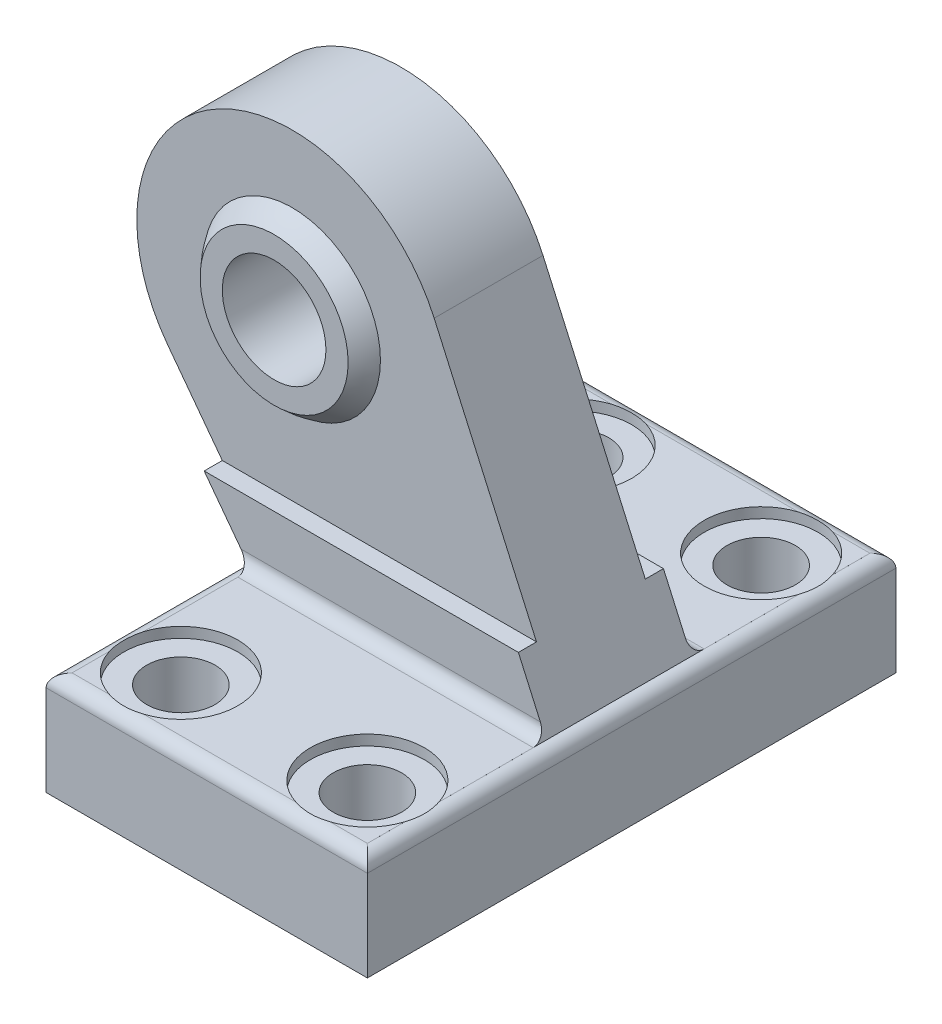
ISO-10303-21;
HEADER;
FILE_DESCRIPTION(('STEP AP214'),'2;1');
FILE_NAME('part.step','',(''),(''),'','','');
FILE_SCHEMA(('AUTOMOTIVE_DESIGN { 1 0 10303 214 1 1 1 1 }'));
ENDSEC;
DATA;
#1=APPLICATION_CONTEXT('core data for automotive mechanical design processes');
#2=APPLICATION_PROTOCOL_DEFINITION('international standard','automotive_design',2000,#1);
#3=PRODUCT_CONTEXT('',#1,'mechanical');
#4=PRODUCT('Part','Part','',(#3));
#5=PRODUCT_RELATED_PRODUCT_CATEGORY('part','',(#4));
#6=PRODUCT_DEFINITION_FORMATION('','',#4);
#7=PRODUCT_DEFINITION_CONTEXT('part definition',#1,'design');
#8=PRODUCT_DEFINITION('design','',#6,#7);
#9=PRODUCT_DEFINITION_SHAPE('','',#8);
#10=(LENGTH_UNIT() NAMED_UNIT(*) SI_UNIT(.MILLI.,.METRE.));
#11=(NAMED_UNIT(*) PLANE_ANGLE_UNIT() SI_UNIT($,.RADIAN.));
#12=(NAMED_UNIT(*) SI_UNIT($,.STERADIAN.) SOLID_ANGLE_UNIT());
#13=UNCERTAINTY_MEASURE_WITH_UNIT(LENGTH_MEASURE(1.E-05),#10,'distance_accuracy_value','');
#14=(GEOMETRIC_REPRESENTATION_CONTEXT(3) GLOBAL_UNCERTAINTY_ASSIGNED_CONTEXT((#13)) GLOBAL_UNIT_ASSIGNED_CONTEXT((#10,
#11,#12)) REPRESENTATION_CONTEXT('',''));
#15=CARTESIAN_POINT('',(0.,0.,0.));
#16=DIRECTION('',(0.,0.,1.));
#17=DIRECTION('',(1.,0.,0.));
#18=AXIS2_PLACEMENT_3D('',#15,#16,#17);
#19=CARTESIAN_POINT('',(-51.,10.001,-8.25));
#20=DIRECTION('',(0.,-1.,0.));
#21=DIRECTION('',(0.,0.,-1.));
#22=AXIS2_PLACEMENT_3D('',#19,#20,#21);
#23=PLANE('',#22);
#24=DIRECTION('',(1.,0.,0.));
#25=VECTOR('',#24,1.);
#26=CARTESIAN_POINT('',(-51.,10.001,-24.249));
#27=LINE('',#26,#25);
#28=CARTESIAN_POINT('',(10.6425586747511,10.001,-24.249));
#29=VERTEX_POINT('',#28);
#30=CARTESIAN_POINT('',(14.2495535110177,10.001,-24.249));
#31=VERTEX_POINT('',#30);
#32=EDGE_CURVE('E260',#29,#31,#27,.T.);
#33=ORIENTED_EDGE('',*,*,#32,.F.);
#34=CARTESIAN_POINT('',(9.,10.001,-19.));
#35=DIRECTION('',(0.,-1.,0.));
#36=DIRECTION('',(0.,0.,-1.));
#37=AXIS2_PLACEMENT_3D('',#34,#35,#36);
#38=CIRCLE('',#37,5.5);
#39=CARTESIAN_POINT('',(14.2495535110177,10.001,-20.6407888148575));
#40=VERTEX_POINT('',#39);
#41=EDGE_CURVE('E47',#29,#40,#38,.T.);
#42=ORIENTED_EDGE('',*,*,#41,.T.);
#43=DIRECTION('',(0.,0.,-1.));
#44=VECTOR('',#43,1.);
#45=CARTESIAN_POINT('',(14.2495535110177,10.001,-25.5));
#46=LINE('',#45,#44);
#47=EDGE_CURVE('E638',#40,#31,#46,.T.);
#48=ORIENTED_EDGE('',*,*,#47,.T.);
#49=EDGE_LOOP('',(#33,#42,#48));
#50=FACE_BOUND('',#49,.T.);
#51=ADVANCED_FACE('F31',(#50),#23,.F.);
#52=CARTESIAN_POINT('',(14.25,10.,-25.5));
#53=DIRECTION('',(0.9131173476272,0.407696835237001,0.));
#54=DIRECTION('',(-0.407696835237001,0.9131173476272,0.));
#55=AXIS2_PLACEMENT_3D('',#52,#53,#54);
#56=PLANE('',#55);
#57=CARTESIAN_POINT('',(9.,21.7584088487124,-19.));
#58=DIRECTION('',(0.9131173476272,0.407696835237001,0.));
#59=DIRECTION('',(0.407696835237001,-0.9131173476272,0.));
#60=AXIS2_PLACEMENT_3D('',#57,#58,#59);
#61=ELLIPSE('',#60,13.4904162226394,5.5);
#62=CARTESIAN_POINT('',(14.25,10.,-20.6393596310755));
#63=VERTEX_POINT('',#62);
#64=EDGE_CURVE('E488',#63,#40,#61,.T.);
#65=ORIENTED_EDGE('',*,*,#64,.F.);
#66=DIRECTION('',(0.,0.,1.));
#67=VECTOR('',#66,1.);
#68=CARTESIAN_POINT('',(14.25,10.,-25.5));
#69=LINE('',#68,#67);
#70=CARTESIAN_POINT('',(14.25,10.,-24.2989899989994));
#71=VERTEX_POINT('',#70);
#72=EDGE_CURVE('E648',#71,#63,#69,.T.);
#73=ORIENTED_EDGE('',*,*,#72,.F.);
#74=CARTESIAN_POINT('',(14.8076647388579,8.75099999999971,-24.2489999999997));
#75=DIRECTION('',(0.9131173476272,0.407696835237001,0.));
#76=DIRECTION('',(0.407696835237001,-0.9131173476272,0.));
#77=AXIS2_PLACEMENT_3D('',#74,#75,#76);
#78=ELLIPSE('',#77,1.36893686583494,1.25000000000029);
#79=EDGE_CURVE('E382',#31,#71,#78,.F.);
#80=ORIENTED_EDGE('',*,*,#79,.F.);
#81=ORIENTED_EDGE('',*,*,#47,.F.);
#82=EDGE_LOOP('',(#65,#73,#80,#81));
#83=FACE_BOUND('',#82,.T.);
#84=ADVANCED_FACE('F646',(#83),#56,.T.);
#85=CARTESIAN_POINT('',(-24.,23.,-25.5));
#86=DIRECTION('',(-0.8,-0.6,0.));
#87=DIRECTION('',(0.6,-0.8,0.));
#88=AXIS2_PLACEMENT_3D('',#85,#86,#87);
#89=PLANE('',#88);
#90=CARTESIAN_POINT('',(-9.,3.,-19.));
#91=DIRECTION('',(-0.8,-0.6,0.));
#92=DIRECTION('',(0.6,-0.8,0.));
#93=AXIS2_PLACEMENT_3D('',#90,#91,#92);
#94=ELLIPSE('',#93,9.16666666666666,5.5);
#95=CARTESIAN_POINT('',(-14.2499999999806,10.,-17.3606403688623));
#96=VERTEX_POINT('',#95);
#97=CARTESIAN_POINT('',(-14.25075,10.001,-17.3630441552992));
#98=VERTEX_POINT('',#97);
#99=EDGE_CURVE('E426',#96,#98,#94,.T.);
#100=ORIENTED_EDGE('',*,*,#99,.F.);
#101=DIRECTION('',(0.,0.,1.));
#102=VECTOR('',#101,1.);
#103=CARTESIAN_POINT('',(-14.25,10.,-25.5));
#104=LINE('',#103,#102);
#105=CARTESIAN_POINT('',(-14.25,10.,17.3606403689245));
#106=VERTEX_POINT('',#105);
#107=EDGE_CURVE('E545',#96,#106,#104,.T.);
#108=ORIENTED_EDGE('',*,*,#107,.T.);
#109=CARTESIAN_POINT('',(-9.,3.,19.));
#110=DIRECTION('',(-0.8,-0.6,0.));
#111=DIRECTION('',(0.6,-0.8,0.));
#112=AXIS2_PLACEMENT_3D('',#109,#110,#111);
#113=ELLIPSE('',#112,9.16666666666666,5.5);
#114=CARTESIAN_POINT('',(-14.25075,10.001,17.3630441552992));
#115=VERTEX_POINT('',#114);
#116=EDGE_CURVE('E440',#115,#106,#113,.T.);
#117=ORIENTED_EDGE('',*,*,#116,.F.);
#118=DIRECTION('',(0.,0.,1.));
#119=VECTOR('',#118,1.);
#120=CARTESIAN_POINT('',(-14.25075,10.001,-25.5));
#121=LINE('',#120,#119);
#122=CARTESIAN_POINT('',(-14.25075,10.001,8.25));
#123=VERTEX_POINT('',#122);
#124=EDGE_CURVE('E556',#123,#115,#121,.T.);
#125=ORIENTED_EDGE('',*,*,#124,.F.);
#126=CARTESIAN_POINT('',(-15.1882500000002,11.2510000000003,8.25000000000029));
#127=DIRECTION('',(-0.8,-0.6,0.));
#128=DIRECTION('',(0.6,-0.8,0.));
#129=AXIS2_PLACEMENT_3D('',#126,#127,#128);
#130=ELLIPSE('',#129,1.56250000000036,1.25000000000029);
#131=CARTESIAN_POINT('',(-15.18825,11.251,7.));
#132=VERTEX_POINT('',#131);
#133=EDGE_CURVE('E559',#132,#123,#130,.T.);
#134=ORIENTED_EDGE('',*,*,#133,.F.);
#135=DIRECTION('',(0.6,-0.8,0.));
#136=VECTOR('',#135,1.);
#137=CARTESIAN_POINT('',(-24.,23.,7.));
#138=LINE('',#137,#136);
#139=CARTESIAN_POINT('',(-18.75,16.,7.));
#140=VERTEX_POINT('',#139);
#141=EDGE_CURVE('E561',#140,#132,#138,.T.);
#142=ORIENTED_EDGE('',*,*,#141,.F.);
#143=DIRECTION('',(0.,0.,1.));
#144=VECTOR('',#143,1.);
#145=CARTESIAN_POINT('',(-18.75,16.,-25.5));
#146=LINE('',#145,#144);
#147=CARTESIAN_POINT('',(-18.75,16.,5.25));
#148=VERTEX_POINT('',#147);
#149=EDGE_CURVE('E563',#148,#140,#146,.T.);
#150=ORIENTED_EDGE('',*,*,#149,.F.);
#151=DIRECTION('',(0.6,-0.8,0.));
#152=VECTOR('',#151,1.);
#153=CARTESIAN_POINT('',(-24.,23.,5.25));
#154=LINE('',#153,#152);
#155=CARTESIAN_POINT('',(-24.,23.,5.25));
#156=VERTEX_POINT('',#155);
#157=EDGE_CURVE('E565',#156,#148,#154,.T.);
#158=ORIENTED_EDGE('',*,*,#157,.F.);
#159=DIRECTION('',(0.,0.,1.));
#160=VECTOR('',#159,1.);
#161=CARTESIAN_POINT('',(-24.,23.,-25.5));
#162=LINE('',#161,#160);
#163=CARTESIAN_POINT('',(-24.,23.,-5.25));
#164=VERTEX_POINT('',#163);
#165=EDGE_CURVE('E547',#164,#156,#162,.T.);
#166=ORIENTED_EDGE('',*,*,#165,.F.);
#167=DIRECTION('',(-0.6,0.8,0.));
#168=VECTOR('',#167,1.);
#169=CARTESIAN_POINT('',(-24.,23.,-5.25));
#170=LINE('',#169,#168);
#171=CARTESIAN_POINT('',(-18.75,16.,-5.25));
#172=VERTEX_POINT('',#171);
#173=EDGE_CURVE('E567',#172,#164,#170,.T.);
#174=ORIENTED_EDGE('',*,*,#173,.F.);
#175=DIRECTION('',(0.,0.,1.));
#176=VECTOR('',#175,1.);
#177=CARTESIAN_POINT('',(-18.75,16.,-25.5));
#178=LINE('',#177,#176);
#179=CARTESIAN_POINT('',(-18.75,16.,-7.));
#180=VERTEX_POINT('',#179);
#181=EDGE_CURVE('E569',#180,#172,#178,.T.);
#182=ORIENTED_EDGE('',*,*,#181,.F.);
#183=DIRECTION('',(-0.6,0.8,0.));
#184=VECTOR('',#183,1.);
#185=CARTESIAN_POINT('',(-24.,23.,-7.));
#186=LINE('',#185,#184);
#187=CARTESIAN_POINT('',(-15.18825,11.251,-7.));
#188=VERTEX_POINT('',#187);
#189=EDGE_CURVE('E572',#188,#180,#186,.T.);
#190=ORIENTED_EDGE('',*,*,#189,.F.);
#191=CARTESIAN_POINT('',(-15.1882500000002,11.2510000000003,-8.25000000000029));
#192=DIRECTION('',(-0.8,-0.6,0.));
#193=DIRECTION('',(0.6,-0.8,0.));
#194=AXIS2_PLACEMENT_3D('',#191,#192,#193);
#195=ELLIPSE('',#194,1.56250000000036,1.25000000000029);
#196=CARTESIAN_POINT('',(-14.25075,10.001,-8.25));
#197=VERTEX_POINT('',#196);
#198=EDGE_CURVE('E574',#197,#188,#195,.T.);
#199=ORIENTED_EDGE('',*,*,#198,.F.);
#200=DIRECTION('',(0.,0.,1.));
#201=VECTOR('',#200,1.);
#202=CARTESIAN_POINT('',(-14.25075,10.001,-25.5));
#203=LINE('',#202,#201);
#204=EDGE_CURVE('E576',#98,#197,#203,.T.);
#205=ORIENTED_EDGE('',*,*,#204,.F.);
#206=EDGE_LOOP('',(#100,#108,#117,#125,#134,#142,#150,#158,#166,#174,#182,#190,#199,#205));
#207=FACE_BOUND('',#206,.T.);
#208=ADVANCED_FACE('F710',(#207),#89,.T.);
#209=CARTESIAN_POINT('',(14.2495535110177,10.001,-8.25));
#210=VERTEX_POINT('',#209);
#211=CARTESIAN_POINT('',(14.2495535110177,10.001,-17.3592111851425));
#212=VERTEX_POINT('',#211);
#213=EDGE_CURVE('E254',#210,#212,#46,.T.);
#214=ORIENTED_EDGE('',*,*,#213,.T.);
#215=CARTESIAN_POINT('',(7.35744132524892,10.001,-24.249));
#216=VERTEX_POINT('',#215);
#217=EDGE_CURVE('E240',#212,#216,#38,.T.);
#218=ORIENTED_EDGE('',*,*,#217,.T.);
#219=CARTESIAN_POINT('',(-7.35744132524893,10.001,-24.249));
#220=VERTEX_POINT('',#219);
#221=EDGE_CURVE('E251',#220,#216,#27,.T.);
#222=ORIENTED_EDGE('',*,*,#221,.F.);
#223=CARTESIAN_POINT('',(-9.,10.001,-19.));
#224=DIRECTION('',(0.,-1.,0.));
#225=DIRECTION('',(0.,0.,-1.));
#226=AXIS2_PLACEMENT_3D('',#223,#224,#225);
#227=CIRCLE('',#226,5.5);
#228=EDGE_CURVE('E40',#220,#98,#227,.T.);
#229=ORIENTED_EDGE('',*,*,#228,.T.);
#230=ORIENTED_EDGE('',*,*,#204,.T.);
#231=DIRECTION('',(1.,0.,0.));
#232=VECTOR('',#231,1.);
#233=CARTESIAN_POINT('',(-51.,10.001,-8.25));
#234=LINE('',#233,#232);
#235=EDGE_CURVE('E263',#197,#210,#234,.T.);
#236=ORIENTED_EDGE('',*,*,#235,.T.);
#237=EDGE_LOOP('',(#214,#218,#222,#229,#230,#236));
#238=FACE_BOUND('',#237,.T.);
#239=ADVANCED_FACE('F249',(#238),#23,.F.);
#240=CARTESIAN_POINT('',(-14.2499999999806,10.,20.6393596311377));
#241=VERTEX_POINT('',#240);
#242=CARTESIAN_POINT('',(-14.25075,10.001,20.6369558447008));
#243=VERTEX_POINT('',#242);
#244=EDGE_CURVE('E453',#241,#243,#113,.T.);
#245=ORIENTED_EDGE('',*,*,#244,.F.);
#246=CARTESIAN_POINT('',(-14.25,10.,24.2989899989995));
#247=VERTEX_POINT('',#246);
#248=EDGE_CURVE('E546',#241,#247,#104,.T.);
#249=ORIENTED_EDGE('',*,*,#248,.T.);
#250=CARTESIAN_POINT('',(-13.3132499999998,8.75099999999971,24.2489999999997));
#251=DIRECTION('',(-0.8,-0.6,0.));
#252=DIRECTION('',(0.6,-0.8,0.));
#253=AXIS2_PLACEMENT_3D('',#250,#251,#252);
#254=ELLIPSE('',#253,1.56250000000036,1.25000000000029);
#255=CARTESIAN_POINT('',(-14.25075,10.001,24.249));
#256=VERTEX_POINT('',#255);
#257=EDGE_CURVE('E551',#256,#247,#254,.F.);
#258=ORIENTED_EDGE('',*,*,#257,.F.);
#259=EDGE_CURVE('E554',#243,#256,#121,.T.);
#260=ORIENTED_EDGE('',*,*,#259,.F.);
#261=EDGE_LOOP('',(#245,#249,#258,#260));
#262=FACE_BOUND('',#261,.T.);
#263=ADVANCED_FACE('F684',(#262),#89,.T.);
#264=CARTESIAN_POINT('',(-51.,10.001,24.249));
#265=DIRECTION('',(0.,-1.,0.));
#266=DIRECTION('',(0.,0.,-1.));
#267=AXIS2_PLACEMENT_3D('',#264,#265,#266);
#268=PLANE('',#267);
#269=DIRECTION('',(1.,0.,0.));
#270=VECTOR('',#269,1.);
#271=CARTESIAN_POINT('',(-51.,10.001,24.249));
#272=LINE('',#271,#270);
#273=CARTESIAN_POINT('',(-10.6425586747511,10.001,24.249));
#274=VERTEX_POINT('',#273);
#275=EDGE_CURVE('E289',#256,#274,#272,.T.);
#276=ORIENTED_EDGE('',*,*,#275,.T.);
#277=CARTESIAN_POINT('',(-9.,10.001,19.));
#278=DIRECTION('',(0.,-1.,0.));
#279=DIRECTION('',(0.,0.,-1.));
#280=AXIS2_PLACEMENT_3D('',#277,#278,#279);
#281=CIRCLE('',#280,5.5);
#282=EDGE_CURVE('E470',#274,#243,#281,.T.);
#283=ORIENTED_EDGE('',*,*,#282,.T.);
#284=ORIENTED_EDGE('',*,*,#259,.T.);
#285=EDGE_LOOP('',(#276,#283,#284));
#286=FACE_BOUND('',#285,.T.);
#287=ADVANCED_FACE('F679',(#286),#268,.F.);
#288=CARTESIAN_POINT('',(14.25,10.,-17.3606403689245));
#289=VERTEX_POINT('',#288);
#290=EDGE_CURVE('E489',#212,#289,#61,.T.);
#291=ORIENTED_EDGE('',*,*,#290,.F.);
#292=ORIENTED_EDGE('',*,*,#213,.F.);
#293=CARTESIAN_POINT('',(13.6914422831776,11.2510000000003,-8.25000000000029));
#294=DIRECTION('',(0.9131173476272,0.407696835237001,0.));
#295=DIRECTION('',(0.407696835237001,-0.9131173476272,0.));
#296=AXIS2_PLACEMENT_3D('',#293,#294,#295);
#297=ELLIPSE('',#296,1.36893686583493,1.25000000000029);
#298=CARTESIAN_POINT('',(13.6914422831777,11.251,-7.));
#299=VERTEX_POINT('',#298);
#300=EDGE_CURVE('E637',#299,#210,#297,.T.);
#301=ORIENTED_EDGE('',*,*,#300,.F.);
#302=DIRECTION('',(0.407696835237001,-0.9131173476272,0.));
#303=VECTOR('',#302,1.);
#304=CARTESIAN_POINT('',(14.25,10.,-7.));
#305=LINE('',#304,#303);
#306=CARTESIAN_POINT('',(11.5710661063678,16.,-7.));
#307=VERTEX_POINT('',#306);
#308=EDGE_CURVE('E635',#307,#299,#305,.T.);
#309=ORIENTED_EDGE('',*,*,#308,.F.);
#310=DIRECTION('',(0.,0.,-1.));
#311=VECTOR('',#310,1.);
#312=CARTESIAN_POINT('',(11.5710661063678,16.,-25.5));
#313=LINE('',#312,#311);
#314=CARTESIAN_POINT('',(11.5710661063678,16.,-5.25));
#315=VERTEX_POINT('',#314);
#316=EDGE_CURVE('E633',#315,#307,#313,.T.);
#317=ORIENTED_EDGE('',*,*,#316,.F.);
#318=DIRECTION('',(0.407696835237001,-0.9131173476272,0.));
#319=VECTOR('',#318,1.);
#320=CARTESIAN_POINT('',(14.25,10.,-5.25));
#321=LINE('',#320,#319);
#322=CARTESIAN_POINT('',(1.696760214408,38.115452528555,-5.25));
#323=VERTEX_POINT('',#322);
#324=EDGE_CURVE('E631',#323,#315,#321,.T.);
#325=ORIENTED_EDGE('',*,*,#324,.F.);
#326=DIRECTION('',(0.,0.,1.));
#327=VECTOR('',#326,1.);
#328=CARTESIAN_POINT('',(1.696760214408,38.115452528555,-25.5));
#329=LINE('',#328,#327);
#330=CARTESIAN_POINT('',(1.696760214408,38.115452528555,5.25));
#331=VERTEX_POINT('',#330);
#332=EDGE_CURVE('E555',#323,#331,#329,.T.);
#333=ORIENTED_EDGE('',*,*,#332,.T.);
#334=DIRECTION('',(-0.407696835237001,0.9131173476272,0.));
#335=VECTOR('',#334,1.);
#336=CARTESIAN_POINT('',(14.25,10.,5.25));
#337=LINE('',#336,#335);
#338=CARTESIAN_POINT('',(11.5710661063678,16.,5.25));
#339=VERTEX_POINT('',#338);
#340=EDGE_CURVE('E627',#339,#331,#337,.T.);
#341=ORIENTED_EDGE('',*,*,#340,.F.);
#342=DIRECTION('',(0.,0.,-1.));
#343=VECTOR('',#342,1.);
#344=CARTESIAN_POINT('',(11.5710661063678,16.,-25.5));
#345=LINE('',#344,#343);
#346=CARTESIAN_POINT('',(11.5710661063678,16.,7.));
#347=VERTEX_POINT('',#346);
#348=EDGE_CURVE('E623',#347,#339,#345,.T.);
#349=ORIENTED_EDGE('',*,*,#348,.F.);
#350=DIRECTION('',(-0.407696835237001,0.9131173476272,0.));
#351=VECTOR('',#350,1.);
#352=CARTESIAN_POINT('',(14.25,10.,7.));
#353=LINE('',#352,#351);
#354=CARTESIAN_POINT('',(13.6914422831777,11.251,7.));
#355=VERTEX_POINT('',#354);
#356=EDGE_CURVE('E621',#355,#347,#353,.T.);
#357=ORIENTED_EDGE('',*,*,#356,.F.);
#358=CARTESIAN_POINT('',(13.6914422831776,11.2510000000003,8.25000000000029));
#359=DIRECTION('',(0.9131173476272,0.407696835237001,0.));
#360=DIRECTION('',(0.407696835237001,-0.9131173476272,0.));
#361=AXIS2_PLACEMENT_3D('',#358,#359,#360);
#362=ELLIPSE('',#361,1.36893686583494,1.25000000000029);
#363=CARTESIAN_POINT('',(14.2495535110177,10.001,8.25));
#364=VERTEX_POINT('',#363);
#365=EDGE_CURVE('E613',#364,#355,#362,.T.);
#366=ORIENTED_EDGE('',*,*,#365,.F.);
#367=DIRECTION('',(0.,0.,-1.));
#368=VECTOR('',#367,1.);
#369=CARTESIAN_POINT('',(14.2495535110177,10.001,-25.5));
#370=LINE('',#369,#368);
#371=CARTESIAN_POINT('',(14.2495535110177,10.001,17.3592111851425));
#372=VERTEX_POINT('',#371);
#373=EDGE_CURVE('E607',#372,#364,#370,.T.);
#374=ORIENTED_EDGE('',*,*,#373,.F.);
#375=CARTESIAN_POINT('',(9.,21.7584088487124,19.));
#376=DIRECTION('',(0.9131173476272,0.407696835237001,0.));
#377=DIRECTION('',(0.407696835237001,-0.9131173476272,0.));
#378=AXIS2_PLACEMENT_3D('',#375,#376,#377);
#379=ELLIPSE('',#378,13.4904162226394,5.5);
#380=CARTESIAN_POINT('',(14.25,10.,17.3606403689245));
#381=VERTEX_POINT('',#380);
#382=EDGE_CURVE('E338',#381,#372,#379,.T.);
#383=ORIENTED_EDGE('',*,*,#382,.F.);
#384=EDGE_CURVE('E662',#289,#381,#69,.T.);
#385=ORIENTED_EDGE('',*,*,#384,.F.);
#386=EDGE_LOOP('',(#291,#292,#301,#309,#317,#325,#333,#341,#349,#357,#366,#374,#383,#385));
#387=FACE_BOUND('',#386,.T.);
#388=ADVANCED_FACE('F611',(#387),#56,.T.);
#389=CARTESIAN_POINT('',(14.2495535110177,10.001,24.249));
#390=VERTEX_POINT('',#389);
#391=CARTESIAN_POINT('',(14.2495535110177,10.001,20.6407888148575));
#392=VERTEX_POINT('',#391);
#393=EDGE_CURVE('E614',#390,#392,#370,.T.);
#394=ORIENTED_EDGE('',*,*,#393,.T.);
#395=CARTESIAN_POINT('',(9.,10.001,19.));
#396=DIRECTION('',(0.,-1.,0.));
#397=DIRECTION('',(0.,0.,-1.));
#398=AXIS2_PLACEMENT_3D('',#395,#396,#397);
#399=CIRCLE('',#398,5.5);
#400=CARTESIAN_POINT('',(10.6425586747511,10.001,24.249));
#401=VERTEX_POINT('',#400);
#402=EDGE_CURVE('E595',#392,#401,#399,.T.);
#403=ORIENTED_EDGE('',*,*,#402,.T.);
#404=EDGE_CURVE('E293',#401,#390,#272,.T.);
#405=ORIENTED_EDGE('',*,*,#404,.T.);
#406=EDGE_LOOP('',(#394,#403,#405));
#407=FACE_BOUND('',#406,.T.);
#408=ADVANCED_FACE('F675',(#407),#268,.F.);
#409=CARTESIAN_POINT('',(-12.,31.9999999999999,-25.5));
#410=DIRECTION('',(0.,0.,1.));
#411=DIRECTION('',(1.,0.,0.));
#412=AXIS2_PLACEMENT_3D('',#409,#410,#411);
#413=CYLINDRICAL_SURFACE('',#412,15.);
#414=CARTESIAN_POINT('',(-12.,31.9999999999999,-5.25));
#415=DIRECTION('',(0.,0.,1.));
#416=DIRECTION('',(1.,0.,0.));
#417=AXIS2_PLACEMENT_3D('',#414,#415,#416);
#418=CIRCLE('',#417,15.);
#419=EDGE_CURVE('E629',#164,#323,#418,.F.);
#420=ORIENTED_EDGE('',*,*,#419,.F.);
#421=ORIENTED_EDGE('',*,*,#165,.T.);
#422=CARTESIAN_POINT('',(-12.,31.9999999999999,5.25));
#423=DIRECTION('',(0.,0.,-1.));
#424=DIRECTION('',(-1.,0.,0.));
#425=AXIS2_PLACEMENT_3D('',#422,#423,#424);
#426=CIRCLE('',#425,15.);
#427=EDGE_CURVE('E625',#331,#156,#426,.F.);
#428=ORIENTED_EDGE('',*,*,#427,.F.);
#429=ORIENTED_EDGE('',*,*,#332,.F.);
#430=EDGE_LOOP('',(#420,#421,#428,#429));
#431=FACE_BOUND('',#430,.T.);
#432=ADVANCED_FACE('F33',(#431),#413,.T.);
#433=CARTESIAN_POINT('',(14.2499999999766,10.,20.6393596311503));
#434=VERTEX_POINT('',#433);
#435=EDGE_CURVE('E359',#392,#434,#379,.T.);
#436=ORIENTED_EDGE('',*,*,#435,.F.);
#437=ORIENTED_EDGE('',*,*,#393,.F.);
#438=CARTESIAN_POINT('',(14.8076647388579,8.75099999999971,24.2489999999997));
#439=DIRECTION('',(0.9131173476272,0.407696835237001,0.));
#440=DIRECTION('',(0.407696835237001,-0.9131173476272,0.));
#441=AXIS2_PLACEMENT_3D('',#438,#439,#440);
#442=ELLIPSE('',#441,1.36893686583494,1.25000000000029);
#443=CARTESIAN_POINT('',(14.25,10.,24.2989899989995));
#444=VERTEX_POINT('',#443);
#445=EDGE_CURVE('E615',#444,#390,#442,.F.);
#446=ORIENTED_EDGE('',*,*,#445,.F.);
#447=EDGE_CURVE('E534',#434,#444,#69,.T.);
#448=ORIENTED_EDGE('',*,*,#447,.F.);
#449=EDGE_LOOP('',(#436,#437,#446,#448));
#450=FACE_BOUND('',#449,.T.);
#451=ADVANCED_FACE('F367',(#450),#56,.T.);
#452=CARTESIAN_POINT('',(14.2499999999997,8.74999999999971,-25.5));
#453=DIRECTION('',(0.,0.,1.));
#454=DIRECTION('',(1.,0.,0.));
#455=AXIS2_PLACEMENT_3D('',#452,#453,#454);
#456=CYLINDRICAL_SURFACE('',#455,1.25000000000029);
#457=CARTESIAN_POINT('',(14.2499999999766,10.,-17.3606403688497));
#458=CARTESIAN_POINT('',(14.2731941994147,9.99998811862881,-17.4349159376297));
#459=CARTESIAN_POINT('',(14.2948084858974,9.99935436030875,-17.5096782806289));
#460=CARTESIAN_POINT('',(14.3348433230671,9.99728145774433,-17.6600386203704));
#461=CARTESIAN_POINT('',(14.3532640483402,9.99584235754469,-17.7356365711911));
#462=CARTESIAN_POINT('',(14.3868849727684,9.99259660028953,-17.8875590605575));
#463=CARTESIAN_POINT('',(14.4020842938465,9.990789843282,-17.9638837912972));
#464=CARTESIAN_POINT('',(14.429231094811,9.98715892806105,-18.1171042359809));
#465=CARTESIAN_POINT('',(14.4411785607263,9.98533476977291,-18.1939999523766));
#466=CARTESIAN_POINT('',(14.4715937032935,9.9803765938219,-18.4214959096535));
#467=CARTESIAN_POINT('',(14.485479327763,9.97764366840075,-18.5727454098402));
#468=CARTESIAN_POINT('',(14.5006912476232,9.9746283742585,-18.8758417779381));
#469=CARTESIAN_POINT('',(14.502021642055,9.97434520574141,-19.0276884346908));
#470=CARTESIAN_POINT('',(14.4930820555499,9.97613992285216,-19.3017717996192));
#471=CARTESIAN_POINT('',(14.4849937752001,9.97777421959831,-19.4240869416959));
#472=CARTESIAN_POINT('',(14.4606722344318,9.98218143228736,-19.6678817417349));
#473=CARTESIAN_POINT('',(14.444439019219,9.98495434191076,-19.7893614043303));
#474=CARTESIAN_POINT('',(14.4034766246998,9.99071827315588,-20.0334749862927));
#475=CARTESIAN_POINT('',(14.3785784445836,9.99371262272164,-20.1560807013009));
#476=CARTESIAN_POINT('',(14.335008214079,9.99719031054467,-20.3385061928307));
#477=CARTESIAN_POINT('',(14.3194458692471,9.99818061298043,-20.3990731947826));
#478=CARTESIAN_POINT('',(14.2862626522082,9.99958352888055,-20.5196502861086));
#479=CARTESIAN_POINT('',(14.2686416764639,9.99999611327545,-20.5796603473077));
#480=CARTESIAN_POINT('',(14.2499999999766,10.,-20.6393596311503));
#481=B_SPLINE_CURVE_WITH_KNOTS('',3,(#457,#458,#459,#460,#461,#462,#463,#464,#465,#466,#467,
#468,#469,#470,#471,#472,#473,#474,#475,#476,#477,#478,#479,#480),.UNSPECIFIED.,.F.,.F.,(4,2,2,
2,2,2,2,2,2,2,2,4),(0.,0.233409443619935,0.466806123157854,0.700266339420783,0.933727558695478,
1.38888549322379,1.84389482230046,2.21139988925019,2.57890291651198,2.95401748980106,
3.14161043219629,3.32921281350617),.UNSPECIFIED.);
#482=EDGE_CURVE('E483',#289,#63,#481,.T.);
#483=ORIENTED_EDGE('',*,*,#482,.F.);
#484=ORIENTED_EDGE('',*,*,#384,.T.);
#485=CARTESIAN_POINT('',(14.2499999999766,10.,20.6393596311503));
#486=CARTESIAN_POINT('',(14.2731941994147,9.99998811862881,20.5650840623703));
#487=CARTESIAN_POINT('',(14.2948084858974,9.99935436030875,20.4903217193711));
#488=CARTESIAN_POINT('',(14.3348433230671,9.99728145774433,20.3399613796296));
#489=CARTESIAN_POINT('',(14.3532640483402,9.99584235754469,20.2643634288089));
#490=CARTESIAN_POINT('',(14.3868849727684,9.99259660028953,20.1124409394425));
#491=CARTESIAN_POINT('',(14.4020842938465,9.990789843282,20.0361162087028));
#492=CARTESIAN_POINT('',(14.429231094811,9.98715892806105,19.8828957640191));
#493=CARTESIAN_POINT('',(14.4411785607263,9.98533476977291,19.8060000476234));
#494=CARTESIAN_POINT('',(14.4715937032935,9.9803765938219,19.5785040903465));
#495=CARTESIAN_POINT('',(14.485479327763,9.97764366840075,19.4272545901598));
#496=CARTESIAN_POINT('',(14.5006912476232,9.9746283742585,19.1241582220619));
#497=CARTESIAN_POINT('',(14.502021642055,9.97434520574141,18.9723115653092));
#498=CARTESIAN_POINT('',(14.4930820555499,9.97613992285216,18.6982282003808));
#499=CARTESIAN_POINT('',(14.4849937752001,9.97777421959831,18.5759130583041));
#500=CARTESIAN_POINT('',(14.4606722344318,9.98218143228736,18.3321182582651));
#501=CARTESIAN_POINT('',(14.444439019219,9.98495434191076,18.2106385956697));
#502=CARTESIAN_POINT('',(14.4034766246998,9.99071827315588,17.9665250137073));
#503=CARTESIAN_POINT('',(14.3785784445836,9.99371262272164,17.8439192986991));
#504=CARTESIAN_POINT('',(14.335008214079,9.99719031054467,17.6614938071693));
#505=CARTESIAN_POINT('',(14.3194458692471,9.99818061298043,17.6009268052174));
#506=CARTESIAN_POINT('',(14.2862626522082,9.99958352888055,17.4803497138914));
#507=CARTESIAN_POINT('',(14.2686416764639,9.99999611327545,17.4203396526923));
#508=CARTESIAN_POINT('',(14.2499999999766,10.,17.3606403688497));
#509=B_SPLINE_CURVE_WITH_KNOTS('',3,(#485,#486,#487,#488,#489,#490,#491,#492,#493,#494,#495,
#496,#497,#498,#499,#500,#501,#502,#503,#504,#505,#506,#507,#508),.UNSPECIFIED.,.F.,.F.,(4,2,2,
2,2,2,2,2,2,2,2,4),(0.,0.233409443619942,0.466806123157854,0.700266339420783,0.933727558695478,
1.38888549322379,1.84389482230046,2.2113998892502,2.57890291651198,2.95401748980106,
3.14161043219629,3.32921281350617),.UNSPECIFIED.);
#510=EDGE_CURVE('E353',#434,#381,#509,.T.);
#511=ORIENTED_EDGE('',*,*,#510,.F.);
#512=ORIENTED_EDGE('',*,*,#447,.T.);
#513=CARTESIAN_POINT('',(15.5,8.75,25.4989995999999));
#514=CARTESIAN_POINT('',(15.5000037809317,8.77803351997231,25.4990258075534));
#515=CARTESIAN_POINT('',(15.4990561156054,8.80605050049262,25.4981005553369));
#516=CARTESIAN_POINT('',(15.4953017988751,8.86181431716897,25.4943911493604));
#517=CARTESIAN_POINT('',(15.4924965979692,8.8895613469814,25.491608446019));
#518=CARTESIAN_POINT('',(15.4814277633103,8.97159257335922,25.4806070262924));
#519=CARTESIAN_POINT('',(15.4705090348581,9.02519982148,25.4697335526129));
#520=CARTESIAN_POINT('',(15.4424349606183,9.12878889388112,25.4417516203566));
#521=CARTESIAN_POINT('',(15.4252966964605,9.17878020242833,25.4246602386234));
#522=CARTESIAN_POINT('',(15.3858003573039,9.27454578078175,25.3852608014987));
#523=CARTESIAN_POINT('',(15.363430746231,9.32031041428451,25.362941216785));
#524=CARTESIAN_POINT('',(15.3045388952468,9.42480811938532,25.3041757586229));
#525=CARTESIAN_POINT('',(15.2659637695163,9.48122813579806,25.2656794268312));
#526=CARTESIAN_POINT('',(15.1829178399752,9.58461366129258,25.1828074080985));
#527=CARTESIAN_POINT('',(15.13843496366,9.63155930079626,25.1384196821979));
#528=CARTESIAN_POINT('',(15.0273491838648,9.73277896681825,25.0275999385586));
#529=CARTESIAN_POINT('',(14.9588406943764,9.78287528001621,24.959277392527));
#530=CARTESIAN_POINT('',(14.8170710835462,9.8670198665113,24.8179983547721));
#531=CARTESIAN_POINT('',(14.7438078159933,9.90106083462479,24.7450397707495));
#532=CARTESIAN_POINT('',(14.6411406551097,9.93759844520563,24.6431524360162));
#533=CARTESIAN_POINT('',(14.6129209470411,9.94651814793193,24.6151825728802));
#534=CARTESIAN_POINT('',(14.5562151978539,9.96226926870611,24.5591120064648));
#535=CARTESIAN_POINT('',(14.5277304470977,9.96910794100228,24.5310121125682));
#536=CARTESIAN_POINT('',(14.4816702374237,9.97847154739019,24.4858949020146));
#537=CARTESIAN_POINT('',(14.4642165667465,9.98163465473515,24.468871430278));
#538=CARTESIAN_POINT('',(14.4290044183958,9.98724713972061,24.4347073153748));
#539=CARTESIAN_POINT('',(14.4112446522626,9.98969123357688,24.4175667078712));
#540=CARTESIAN_POINT('',(14.3751535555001,9.99384977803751,24.3836734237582));
#541=CARTESIAN_POINT('',(14.3568183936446,9.99555706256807,24.3669259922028));
#542=CARTESIAN_POINT('',(14.319622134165,9.99820870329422,24.333818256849));
#543=CARTESIAN_POINT('',(14.3007769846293,9.9991665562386,24.3174565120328));
#544=CARTESIAN_POINT('',(14.275466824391,9.99974427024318,24.3050530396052));
#545=CARTESIAN_POINT('',(14.2721087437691,9.99980916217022,24.3035661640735));
#546=CARTESIAN_POINT('',(14.2652162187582,9.99991219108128,24.3011486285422));
#547=CARTESIAN_POINT('',(14.2616835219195,9.99995055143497,24.3002133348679));
#548=CARTESIAN_POINT('',(14.2567618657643,9.99998242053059,24.2994279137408));
#549=CARTESIAN_POINT('',(14.2554206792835,9.99998896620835,24.299265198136));
#550=CARTESIAN_POINT('',(14.2527200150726,9.99999777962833,24.2990454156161));
#551=CARTESIAN_POINT('',(14.2513604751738,10.0000000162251,24.2989891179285));
#552=CARTESIAN_POINT('',(14.2499999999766,10.0000000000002,24.2989899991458));
#553=B_SPLINE_CURVE_WITH_KNOTS('',3,(#513,#514,#515,#516,#517,#518,#519,#520,#521,#522,#523,
#524,#525,#526,#527,#528,#529,#530,#531,#532,#533,#534,#535,#536,#537,#538,#539,#540,#541,#542,
#543,#544,#545,#546,#547,#548,#549,#550,#551,#552),.UNSPECIFIED.,.F.,.F.,(4,2,2,2,2,2,2,2,2,2,2,
2,2,2,2,2,2,2,2,4),(0.,0.0840358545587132,0.168006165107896,0.334373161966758,0.500286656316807,
0.666569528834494,0.900600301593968,1.13511689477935,1.46025220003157,1.78553529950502,
1.9076676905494,2.02936933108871,2.10313962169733,2.17743920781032,2.25244596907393,
2.32606865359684,2.33705805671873,2.34795377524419,2.35200317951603,2.35608174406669),.UNSPECIFIED.);
#554=CARTESIAN_POINT('',(15.4999995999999,8.751,25.499));
#555=VERTEX_POINT('',#554);
#556=EDGE_CURVE('E305',#555,#444,#553,.T.);
#557=ORIENTED_EDGE('',*,*,#556,.F.);
#558=CARTESIAN_POINT('',(14.2499999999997,8.74999999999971,25.499));
#559=DIRECTION('',(0.,0.,-1.));
#560=DIRECTION('',(-1.,0.,0.));
#561=AXIS2_PLACEMENT_3D('',#558,#559,#560);
#562=CIRCLE('',#561,1.25000000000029);
#563=CARTESIAN_POINT('',(15.5,8.75,25.499));
#564=VERTEX_POINT('',#563);
#565=EDGE_CURVE('E656',#564,#555,#562,.F.);
#566=ORIENTED_EDGE('',*,*,#565,.F.);
#567=DIRECTION('',(0.,0.,1.));
#568=VECTOR('',#567,1.);
#569=CARTESIAN_POINT('',(15.5,8.75,-25.5));
#570=LINE('',#569,#568);
#571=CARTESIAN_POINT('',(15.5,8.75,-25.499));
#572=VERTEX_POINT('',#571);
#573=EDGE_CURVE('E532',#572,#564,#570,.T.);
#574=ORIENTED_EDGE('',*,*,#573,.F.);
#575=CARTESIAN_POINT('',(14.2499999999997,8.74999999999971,-25.499));
#576=DIRECTION('',(0.,0.,1.));
#577=DIRECTION('',(1.,0.,0.));
#578=AXIS2_PLACEMENT_3D('',#575,#576,#577);
#579=CIRCLE('',#578,1.25000000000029);
#580=CARTESIAN_POINT('',(15.4999995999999,8.751,-25.499));
#581=VERTEX_POINT('',#580);
#582=EDGE_CURVE('E550',#581,#572,#579,.F.);
#583=ORIENTED_EDGE('',*,*,#582,.F.);
#584=CARTESIAN_POINT('',(14.25,10.,-24.2989899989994));
#585=CARTESIAN_POINT('',(14.2538614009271,10.0000005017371,-24.2989648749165));
#586=CARTESIAN_POINT('',(14.2576716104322,9.99998220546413,-24.2994362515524));
#587=CARTESIAN_POINT('',(14.2650409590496,9.999914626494,-24.3010888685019));
#588=CARTESIAN_POINT('',(14.2686040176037,9.99986614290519,-24.3022517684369));
#589=CARTESIAN_POINT('',(14.2800350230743,9.99966498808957,-24.3068352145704));
#590=CARTESIAN_POINT('',(14.2874776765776,9.99945881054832,-24.3112253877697));
#591=CARTESIAN_POINT('',(14.3019426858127,9.9989414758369,-24.3208853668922));
#592=CARTESIAN_POINT('',(14.3089501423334,9.99862785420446,-24.3261742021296));
#593=CARTESIAN_POINT('',(14.3313913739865,9.99744544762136,-24.3439979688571));
#594=CARTESIAN_POINT('',(14.3462634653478,9.99637643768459,-24.357230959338));
#595=CARTESIAN_POINT('',(14.3756296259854,9.99375678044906,-24.3840653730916));
#596=CARTESIAN_POINT('',(14.3901230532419,9.99220536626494,-24.3976673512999));
#597=CARTESIAN_POINT('',(14.4329862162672,9.98686805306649,-24.438392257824));
#598=CARTESIAN_POINT('',(14.4610703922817,9.98238039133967,-24.4657341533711));
#599=CARTESIAN_POINT('',(14.5344671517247,9.96808051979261,-24.5375905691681));
#600=CARTESIAN_POINT('',(14.5794986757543,9.95669478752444,-24.5820829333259));
#601=CARTESIAN_POINT('',(14.6686607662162,9.92873126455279,-24.6704236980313));
#602=CARTESIAN_POINT('',(14.7127904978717,9.91214887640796,-24.7142714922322));
#603=CARTESIAN_POINT('',(14.799965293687,9.8735295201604,-24.8009861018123));
#604=CARTESIAN_POINT('',(14.8430059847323,9.8514735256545,-24.8438489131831));
#605=CARTESIAN_POINT('',(14.9273576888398,9.80170462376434,-24.9278985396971));
#606=CARTESIAN_POINT('',(14.9686700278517,9.77399615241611,-24.9690866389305));
#607=CARTESIAN_POINT('',(15.0579403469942,9.70579861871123,-25.0581138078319));
#608=CARTESIAN_POINT('',(15.1053420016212,9.66383803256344,-25.1054038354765));
#609=CARTESIAN_POINT('',(15.1951949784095,9.57053984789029,-25.1950575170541));
#610=CARTESIAN_POINT('',(15.2376575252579,9.51922421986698,-25.2374323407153));
#611=CARTESIAN_POINT('',(15.3081204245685,9.41777505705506,-25.3077489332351));
#612=CARTESIAN_POINT('',(15.3373299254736,9.36932837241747,-25.3368974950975));
#613=CARTESIAN_POINT('',(15.389831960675,9.26634321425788,-25.3892830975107));
#614=CARTESIAN_POINT('',(15.4131293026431,9.21180974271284,-25.4125249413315));
#615=CARTESIAN_POINT('',(15.44880382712,9.10756880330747,-25.4481010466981));
#616=CARTESIAN_POINT('',(15.4623772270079,9.05868005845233,-25.4616310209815));
#617=CARTESIAN_POINT('',(15.4835591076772,8.95842294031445,-25.4827272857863));
#618=CARTESIAN_POINT('',(15.4911806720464,8.90706027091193,-25.4903066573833));
#619=CARTESIAN_POINT('',(15.4970403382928,8.83775392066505,-25.4961102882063));
#620=CARTESIAN_POINT('',(15.4981494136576,8.82023370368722,-25.4972052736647));
#621=CARTESIAN_POINT('',(15.4996286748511,8.78514476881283,-25.4986563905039));
#622=CARTESIAN_POINT('',(15.499999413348,8.76757609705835,-25.4990130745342));
#623=CARTESIAN_POINT('',(15.5,8.75,-25.4989995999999));
#624=B_SPLINE_CURVE_WITH_KNOTS('',3,(#584,#585,#586,#587,#588,#589,#590,#591,#592,#593,#594,
#595,#596,#597,#598,#599,#600,#601,#602,#603,#604,#605,#606,#607,#608,#609,#610,#611,#612,#613,
#614,#615,#616,#617,#618,#619,#620,#621,#622,#623),.UNSPECIFIED.,.F.,.F.,(4,2,2,2,2,2,2,2,2,2,2,
2,2,2,2,2,2,2,2,4),(0.,0.0114757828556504,0.022659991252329,0.0483838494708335,
0.0747423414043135,0.13446547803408,0.194284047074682,0.312579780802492,0.505325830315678,
0.698242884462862,0.891840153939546,1.08528606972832,1.3216044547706,1.55737482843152,
1.74759675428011,1.93766349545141,2.09455953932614,2.25110970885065,2.30385440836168,
2.35655961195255),.UNSPECIFIED.);
#625=EDGE_CURVE('E375',#71,#581,#624,.T.);
#626=ORIENTED_EDGE('',*,*,#625,.F.);
#627=ORIENTED_EDGE('',*,*,#72,.T.);
#628=EDGE_LOOP('',(#483,#484,#511,#512,#557,#566,#574,#583,#626,#627));
#629=FACE_BOUND('',#628,.T.);
#630=ADVANCED_FACE('F362',(#629),#456,.T.);
#631=CARTESIAN_POINT('',(15.5,0.,-25.5));
#632=DIRECTION('',(1.,0.,0.));
#633=DIRECTION('',(0.,0.,-1.));
#634=AXIS2_PLACEMENT_3D('',#631,#632,#633);
#635=PLANE('',#634);
#636=DIRECTION('',(0.,-1.,0.));
#637=VECTOR('',#636,1.);
#638=CARTESIAN_POINT('',(15.5,0.,-25.499));
#639=LINE('',#638,#637);
#640=CARTESIAN_POINT('',(15.5,0.,-25.499));
#641=VERTEX_POINT('',#640);
#642=EDGE_CURVE('E523',#572,#641,#639,.T.);
#643=ORIENTED_EDGE('',*,*,#642,.F.);
#644=ORIENTED_EDGE('',*,*,#573,.T.);
#645=DIRECTION('',(0.,1.,0.));
#646=VECTOR('',#645,1.);
#647=CARTESIAN_POINT('',(15.5,0.,25.499));
#648=LINE('',#647,#646);
#649=CARTESIAN_POINT('',(15.5,0.,25.499));
#650=VERTEX_POINT('',#649);
#651=EDGE_CURVE('E531',#650,#564,#648,.T.);
#652=ORIENTED_EDGE('',*,*,#651,.F.);
#653=DIRECTION('',(0.,0.,1.));
#654=VECTOR('',#653,1.);
#655=CARTESIAN_POINT('',(15.5,0.,-25.5));
#656=LINE('',#655,#654);
#657=EDGE_CURVE('E518',#641,#650,#656,.T.);
#658=ORIENTED_EDGE('',*,*,#657,.F.);
#659=EDGE_LOOP('',(#643,#644,#652,#658));
#660=FACE_BOUND('',#659,.T.);
#661=ADVANCED_FACE('F366',(#660),#635,.T.);
#662=CARTESIAN_POINT('',(-15.5,0.,-25.5));
#663=DIRECTION('',(0.,-1.,0.));
#664=DIRECTION('',(0.,0.,-1.));
#665=AXIS2_PLACEMENT_3D('',#662,#663,#664);
#666=PLANE('',#665);
#667=CARTESIAN_POINT('',(9.,0.,-19.));
#668=DIRECTION('',(0.,-1.,0.));
#669=DIRECTION('',(0.,0.,-1.));
#670=AXIS2_PLACEMENT_3D('',#667,#668,#669);
#671=CIRCLE('',#670,3.3);
#672=CARTESIAN_POINT('',(9.,0.,-22.3));
#673=VERTEX_POINT('',#672);
#674=EDGE_CURVE('E35',#673,#673,#671,.T.);
#675=ORIENTED_EDGE('',*,*,#674,.F.);
#676=EDGE_LOOP('',(#675));
#677=FACE_BOUND('',#676,.T.);
#678=CARTESIAN_POINT('',(-9.,0.,-19.));
#679=DIRECTION('',(0.,-1.,0.));
#680=DIRECTION('',(0.,0.,-1.));
#681=AXIS2_PLACEMENT_3D('',#678,#679,#680);
#682=CIRCLE('',#681,3.3);
#683=CARTESIAN_POINT('',(-9.,0.,-22.3));
#684=VERTEX_POINT('',#683);
#685=EDGE_CURVE('E431',#684,#684,#682,.T.);
#686=ORIENTED_EDGE('',*,*,#685,.F.);
#687=EDGE_LOOP('',(#686));
#688=FACE_BOUND('',#687,.T.);
#689=CARTESIAN_POINT('',(-9.,0.,19.));
#690=DIRECTION('',(0.,-1.,0.));
#691=DIRECTION('',(0.,0.,-1.));
#692=AXIS2_PLACEMENT_3D('',#689,#690,#691);
#693=CIRCLE('',#692,3.3);
#694=CARTESIAN_POINT('',(-9.,0.,15.7));
#695=VERTEX_POINT('',#694);
#696=EDGE_CURVE('E456',#695,#695,#693,.T.);
#697=ORIENTED_EDGE('',*,*,#696,.F.);
#698=EDGE_LOOP('',(#697));
#699=FACE_BOUND('',#698,.T.);
#700=CARTESIAN_POINT('',(9.,0.,19.));
#701=DIRECTION('',(0.,-1.,0.));
#702=DIRECTION('',(0.,0.,-1.));
#703=AXIS2_PLACEMENT_3D('',#700,#701,#702);
#704=CIRCLE('',#703,3.3);
#705=CARTESIAN_POINT('',(9.,0.,15.7));
#706=VERTEX_POINT('',#705);
#707=EDGE_CURVE('E511',#706,#706,#704,.T.);
#708=ORIENTED_EDGE('',*,*,#707,.F.);
#709=EDGE_LOOP('',(#708));
#710=FACE_BOUND('',#709,.T.);
#711=DIRECTION('',(-1.,0.,0.));
#712=VECTOR('',#711,1.);
#713=CARTESIAN_POINT('',(-15.5,0.,-25.499));
#714=LINE('',#713,#712);
#715=CARTESIAN_POINT('',(-15.5,0.,-25.499));
#716=VERTEX_POINT('',#715);
#717=EDGE_CURVE('E515',#641,#716,#714,.T.);
#718=ORIENTED_EDGE('',*,*,#717,.F.);
#719=ORIENTED_EDGE('',*,*,#657,.T.);
#720=DIRECTION('',(1.,0.,0.));
#721=VECTOR('',#720,1.);
#722=CARTESIAN_POINT('',(-15.5,0.,25.499));
#723=LINE('',#722,#721);
#724=CARTESIAN_POINT('',(-15.5,0.,25.499));
#725=VERTEX_POINT('',#724);
#726=EDGE_CURVE('E650',#725,#650,#723,.T.);
#727=ORIENTED_EDGE('',*,*,#726,.F.);
#728=DIRECTION('',(0.,0.,1.));
#729=VECTOR('',#728,1.);
#730=CARTESIAN_POINT('',(-15.5,0.,-25.5));
#731=LINE('',#730,#729);
#732=EDGE_CURVE('E520',#716,#725,#731,.T.);
#733=ORIENTED_EDGE('',*,*,#732,.F.);
#734=EDGE_LOOP('',(#718,#719,#727,#733));
#735=FACE_BOUND('',#734,.T.);
#736=ADVANCED_FACE('F501',(#677,#688,#699,#710,#735),#666,.T.);
#737=CARTESIAN_POINT('',(-15.5,8.75,-25.5));
#738=DIRECTION('',(-1.,0.,0.));
#739=DIRECTION('',(0.,0.,1.));
#740=AXIS2_PLACEMENT_3D('',#737,#738,#739);
#741=PLANE('',#740);
#742=DIRECTION('',(0.,1.,0.));
#743=VECTOR('',#742,1.);
#744=CARTESIAN_POINT('',(-15.5,8.75,-25.499));
#745=LINE('',#744,#743);
#746=CARTESIAN_POINT('',(-15.5,8.75,-25.499));
#747=VERTEX_POINT('',#746);
#748=EDGE_CURVE('E524',#716,#747,#745,.T.);
#749=ORIENTED_EDGE('',*,*,#748,.F.);
#750=ORIENTED_EDGE('',*,*,#732,.T.);
#751=DIRECTION('',(0.,-1.,0.));
#752=VECTOR('',#751,1.);
#753=CARTESIAN_POINT('',(-15.5,8.75,25.499));
#754=LINE('',#753,#752);
#755=CARTESIAN_POINT('',(-15.5,8.74999999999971,25.499));
#756=VERTEX_POINT('',#755);
#757=EDGE_CURVE('E649',#756,#725,#754,.T.);
#758=ORIENTED_EDGE('',*,*,#757,.F.);
#759=DIRECTION('',(0.,0.,1.));
#760=VECTOR('',#759,1.);
#761=CARTESIAN_POINT('',(-15.5,8.75,-25.5));
#762=LINE('',#761,#760);
#763=EDGE_CURVE('E536',#747,#756,#762,.T.);
#764=ORIENTED_EDGE('',*,*,#763,.F.);
#765=EDGE_LOOP('',(#749,#750,#758,#764));
#766=FACE_BOUND('',#765,.T.);
#767=ADVANCED_FACE('F504',(#766),#741,.T.);
#768=CARTESIAN_POINT('',(-14.2499999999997,8.74999999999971,-25.5));
#769=DIRECTION('',(0.,0.,1.));
#770=DIRECTION('',(1.,0.,0.));
#771=AXIS2_PLACEMENT_3D('',#768,#769,#770);
#772=CYLINDRICAL_SURFACE('',#771,1.25000000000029);
#773=CARTESIAN_POINT('',(-14.2499999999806,10.,-20.6393596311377));
#774=CARTESIAN_POINT('',(-14.2731941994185,9.99998811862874,-20.5650840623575));
#775=CARTESIAN_POINT('',(-14.294808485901,9.99935436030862,-20.4903217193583));
#776=CARTESIAN_POINT('',(-14.3348433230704,9.9972814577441,-20.3399613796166));
#777=CARTESIAN_POINT('',(-14.3532640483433,9.99584235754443,-20.2643634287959));
#778=CARTESIAN_POINT('',(-14.3868849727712,9.99259660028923,-20.1124409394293));
#779=CARTESIAN_POINT('',(-14.402084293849,9.99078984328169,-20.0361162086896));
#780=CARTESIAN_POINT('',(-14.4292310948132,9.98715892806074,-19.8828957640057));
#781=CARTESIAN_POINT('',(-14.4411785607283,9.9853347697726,-19.8060000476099));
#782=CARTESIAN_POINT('',(-14.471593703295,9.98037659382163,-19.5785040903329));
#783=CARTESIAN_POINT('',(-14.4854793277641,9.97764366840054,-19.4272545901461));
#784=CARTESIAN_POINT('',(-14.5006912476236,9.97462837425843,-19.1241582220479));
#785=CARTESIAN_POINT('',(-14.5020216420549,9.97434520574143,-18.9723115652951));
#786=CARTESIAN_POINT('',(-14.4930820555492,9.9761399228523,-18.6982282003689));
#787=CARTESIAN_POINT('',(-14.4849937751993,9.97777421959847,-18.5759130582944));
#788=CARTESIAN_POINT('',(-14.4606722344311,9.98218143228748,-18.33211825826));
#789=CARTESIAN_POINT('',(-14.4444390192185,9.98495434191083,-18.2106385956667));
#790=CARTESIAN_POINT('',(-14.4034766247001,9.99071827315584,-17.9665250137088));
#791=CARTESIAN_POINT('',(-14.3785784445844,9.99371262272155,-17.8439192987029));
#792=CARTESIAN_POINT('',(-14.3350082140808,9.99719031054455,-17.6614938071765));
#793=CARTESIAN_POINT('',(-14.3194458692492,9.9981806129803,-17.6009268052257));
#794=CARTESIAN_POINT('',(-14.2862626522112,9.99958352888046,-17.480349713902));
#795=CARTESIAN_POINT('',(-14.2686416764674,9.99999611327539,-17.4203396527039));
#796=CARTESIAN_POINT('',(-14.2499999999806,10.,-17.3606403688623));
#797=B_SPLINE_CURVE_WITH_KNOTS('',3,(#773,#774,#775,#776,#777,#778,#779,#780,#781,#782,#783,
#784,#785,#786,#787,#788,#789,#790,#791,#792,#793,#794,#795,#796),.UNSPECIFIED.,.F.,.F.,(4,2,2,
2,2,2,2,2,2,2,2,4),(0.,0.233409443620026,0.466806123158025,0.70026633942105,0.933727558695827,
1.38888549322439,1.84389482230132,2.21139988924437,2.57890291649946,2.95401748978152,
3.14161043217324,3.32921281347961),.UNSPECIFIED.);
#798=CARTESIAN_POINT('',(-14.25,10.,-20.6393596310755));
#799=VERTEX_POINT('',#798);
#800=EDGE_CURVE('E421',#799,#96,#797,.T.);
#801=ORIENTED_EDGE('',*,*,#800,.F.);
#802=CARTESIAN_POINT('',(-14.25,10.,-24.2989899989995));
#803=VERTEX_POINT('',#802);
#804=EDGE_CURVE('E542',#803,#799,#104,.T.);
#805=ORIENTED_EDGE('',*,*,#804,.F.);
#806=CARTESIAN_POINT('',(-15.4999995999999,8.751,-25.499));
#807=CARTESIAN_POINT('',(-15.4999809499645,8.77904666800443,-25.499003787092));
#808=CARTESIAN_POINT('',(-15.4990099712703,8.807075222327,-25.4980552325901));
#809=CARTESIAN_POINT('',(-15.4952078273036,8.86285881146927,-25.4942980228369));
#810=CARTESIAN_POINT('',(-15.4923781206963,8.89061404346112,-25.4914908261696));
#811=CARTESIAN_POINT('',(-15.4812353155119,8.97266403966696,-25.480415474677));
#812=CARTESIAN_POINT('',(-15.4702662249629,9.02627696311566,-25.4694916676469));
#813=CARTESIAN_POINT('',(-15.4420931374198,9.12986499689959,-25.4414107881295));
#814=CARTESIAN_POINT('',(-15.4249063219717,9.1798496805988,-25.4242708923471));
#815=CARTESIAN_POINT('',(-15.3853160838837,9.27559391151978,-25.3847776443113));
#816=CARTESIAN_POINT('',(-15.3629011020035,9.32134377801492,-25.3624127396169));
#817=CARTESIAN_POINT('',(-15.3038841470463,9.425835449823,-25.3035223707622));
#818=CARTESIAN_POINT('',(-15.2652262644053,9.4822557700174,-25.2649434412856));
#819=CARTESIAN_POINT('',(-15.1820163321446,9.58562379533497,-25.1819078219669));
#820=CARTESIAN_POINT('',(-15.137452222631,9.63255160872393,-25.1374391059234));
#821=CARTESIAN_POINT('',(-15.0261770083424,9.73371002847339,-25.0264308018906));
#822=CARTESIAN_POINT('',(-14.9575617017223,9.78375645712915,-24.9580021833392));
#823=CARTESIAN_POINT('',(-14.8155841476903,9.86777779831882,-24.8165174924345));
#824=CARTESIAN_POINT('',(-14.7422197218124,9.90174527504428,-24.7434592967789));
#825=CARTESIAN_POINT('',(-14.6395473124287,9.93811918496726,-24.6415726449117));
#826=CARTESIAN_POINT('',(-14.6114232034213,9.9469687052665,-24.6136994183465));
#827=CARTESIAN_POINT('',(-14.5549124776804,9.96259489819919,-24.5578267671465));
#828=CARTESIAN_POINT('',(-14.5265271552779,9.96937885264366,-24.5298281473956));
#829=CARTESIAN_POINT('',(-14.4806426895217,9.97866373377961,-24.4848908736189));
#830=CARTESIAN_POINT('',(-14.4632649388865,9.98179867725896,-24.4679449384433));
#831=CARTESIAN_POINT('',(-14.4282029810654,9.98736169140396,-24.4339357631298));
#832=CARTESIAN_POINT('',(-14.4105174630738,9.98978443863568,-24.4168725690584));
#833=CARTESIAN_POINT('',(-14.374573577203,9.99390696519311,-24.3831343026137));
#834=CARTESIAN_POINT('',(-14.3563113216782,9.99559952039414,-24.3664645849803));
#835=CARTESIAN_POINT('',(-14.3192560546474,9.99822786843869,-24.3335209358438));
#836=CARTESIAN_POINT('',(-14.3004794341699,9.99917726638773,-24.3172454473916));
#837=CARTESIAN_POINT('',(-14.2752517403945,9.99974861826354,-24.3049556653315));
#838=CARTESIAN_POINT('',(-14.2719007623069,9.99981280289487,-24.3034824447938));
#839=CARTESIAN_POINT('',(-14.2650237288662,9.99991449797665,-24.3010930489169));
#840=CARTESIAN_POINT('',(-14.2614993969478,9.9999522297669,-24.3001722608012));
#841=CARTESIAN_POINT('',(-14.2566157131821,9.99998317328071,-24.2994092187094));
#842=CARTESIAN_POINT('',(-14.2553031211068,9.99998944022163,-24.2992533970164));
#843=CARTESIAN_POINT('',(-14.2526606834,9.99999787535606,-24.2990430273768));
#844=CARTESIAN_POINT('',(-14.2513307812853,10.0000000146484,-24.29898919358));
#845=CARTESIAN_POINT('',(-14.2499999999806,10.0000000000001,-24.2989899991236));
#846=B_SPLINE_CURVE_WITH_KNOTS('',3,(#806,#807,#808,#809,#810,#811,#812,#813,#814,#815,#816,
#817,#818,#819,#820,#821,#822,#823,#824,#825,#826,#827,#828,#829,#830,#831,#832,#833,#834,#835,
#836,#837,#838,#839,#840,#841,#842,#843,#844,#845),.UNSPECIFIED.,.F.,.F.,(4,2,2,2,2,2,2,2,2,2,2,
2,2,2,2,2,2,2,2,4),(0.,0.0840751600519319,0.168084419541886,0.334526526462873,0.500512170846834,
0.666868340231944,0.901142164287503,1.13590194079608,1.46136820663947,1.78698483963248,
1.90867387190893,2.02992880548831,2.10336578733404,2.17733848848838,2.25202712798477,
2.32531418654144,2.3362672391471,2.34712751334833,2.35108952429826,2.35507917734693),.UNSPECIFIED.);
#847=CARTESIAN_POINT('',(-15.4999995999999,8.751,-25.499));
#848=VERTEX_POINT('',#847);
#849=EDGE_CURVE('E383',#848,#803,#846,.T.);
#850=ORIENTED_EDGE('',*,*,#849,.F.);
#851=CARTESIAN_POINT('',(-14.2499999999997,8.74999999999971,-25.499));
#852=DIRECTION('',(0.,0.,1.));
#853=DIRECTION('',(1.,0.,0.));
#854=AXIS2_PLACEMENT_3D('',#851,#852,#853);
#855=CIRCLE('',#854,1.25000000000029);
#856=EDGE_CURVE('E584',#747,#848,#855,.F.);
#857=ORIENTED_EDGE('',*,*,#856,.F.);
#858=ORIENTED_EDGE('',*,*,#763,.T.);
#859=CARTESIAN_POINT('',(-14.2499999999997,8.74999999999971,25.499));
#860=DIRECTION('',(0.,0.,-1.));
#861=DIRECTION('',(-1.,0.,0.));
#862=AXIS2_PLACEMENT_3D('',#859,#860,#861);
#863=CIRCLE('',#862,1.25000000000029);
#864=CARTESIAN_POINT('',(-15.4999995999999,8.751,25.499));
#865=VERTEX_POINT('',#864);
#866=EDGE_CURVE('E582',#865,#756,#863,.F.);
#867=ORIENTED_EDGE('',*,*,#866,.F.);
#868=CARTESIAN_POINT('',(-14.25,10.,24.2989899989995));
#869=CARTESIAN_POINT('',(-14.2538614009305,10.0000005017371,24.2989648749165));
#870=CARTESIAN_POINT('',(-14.2576716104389,9.9999822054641,24.2994362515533));
#871=CARTESIAN_POINT('',(-14.265040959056,9.99991462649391,24.3010888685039));
#872=CARTESIAN_POINT('',(-14.2686040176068,9.99986614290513,24.3022517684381));
#873=CARTESIAN_POINT('',(-14.2800350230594,9.99966498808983,24.3068352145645));
#874=CARTESIAN_POINT('',(-14.2874776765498,9.99945881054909,24.3112253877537));
#875=CARTESIAN_POINT('',(-14.3019426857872,9.99894147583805,24.3208853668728));
#876=CARTESIAN_POINT('',(-14.3089501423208,9.99862785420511,24.3261742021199));
#877=CARTESIAN_POINT('',(-14.3313913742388,9.99744544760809,24.3439979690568));
#878=CARTESIAN_POINT('',(-14.3462634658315,9.99637643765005,24.3572309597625));
#879=CARTESIAN_POINT('',(-14.3756296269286,9.99375678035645,24.3840653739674));
#880=CARTESIAN_POINT('',(-14.390123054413,9.99220536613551,24.397667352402));
#881=CARTESIAN_POINT('',(-14.4329862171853,9.98686805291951,24.438392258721));
#882=CARTESIAN_POINT('',(-14.4610703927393,9.98238039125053,24.4657341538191));
#883=CARTESIAN_POINT('',(-14.5344671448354,9.96808052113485,24.5375905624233));
#884=CARTESIAN_POINT('',(-14.5794986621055,9.95669479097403,24.5820829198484));
#885=CARTESIAN_POINT('',(-14.6686607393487,9.92873127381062,24.6704236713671));
#886=CARTESIAN_POINT('',(-14.7127904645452,9.91214888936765,24.7142714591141));
#887=CARTESIAN_POINT('',(-14.7999652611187,9.87352953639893,24.8009860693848));
#888=CARTESIAN_POINT('',(-14.8430059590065,9.85147353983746,24.8438488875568));
#889=CARTESIAN_POINT('',(-14.9273576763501,9.80170463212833,24.9278985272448));
#890=CARTESIAN_POINT('',(-14.9686700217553,9.77399615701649,24.9690866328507));
#891=CARTESIAN_POINT('',(-15.0579403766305,9.70579859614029,25.0581138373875));
#892=CARTESIAN_POINT('',(-15.1053420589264,9.6638379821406,25.1054038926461));
#893=CARTESIAN_POINT('',(-15.1951950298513,9.57053978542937,25.1950575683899));
#894=CARTESIAN_POINT('',(-15.2376575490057,9.51922418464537,25.237432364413));
#895=CARTESIAN_POINT('',(-15.3081203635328,9.41777514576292,25.3077488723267));
#896=CARTESIAN_POINT('',(-15.3373298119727,9.36932856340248,25.3368973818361));
#897=CARTESIAN_POINT('',(-15.3898318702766,9.26634342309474,25.3892830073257));
#898=CARTESIAN_POINT('',(-15.4131292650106,9.21180984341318,25.4125249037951));
#899=CARTESIAN_POINT('',(-15.4488059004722,9.10756275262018,25.4481031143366));
#900=CARTESIAN_POINT('',(-15.462380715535,9.05866751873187,25.4616344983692));
#901=CARTESIAN_POINT('',(-15.4835637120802,8.95839719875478,25.4827318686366));
#902=CARTESIAN_POINT('',(-15.4911850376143,8.90702784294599,25.4903109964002));
#903=CARTESIAN_POINT('',(-15.4970285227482,8.83788721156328,25.4960985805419));
#904=CARTESIAN_POINT('',(-15.4981297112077,8.82054006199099,25.4971858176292));
#905=CARTESIAN_POINT('',(-15.4996077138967,8.78579787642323,25.498635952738));
#906=CARTESIAN_POINT('',(-15.4999850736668,8.76840288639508,25.4989993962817));
#907=CARTESIAN_POINT('',(-15.4999995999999,8.751,25.499));
#908=B_SPLINE_CURVE_WITH_KNOTS('',3,(#868,#869,#870,#871,#872,#873,#874,#875,#876,#877,#878,
#879,#880,#881,#882,#883,#884,#885,#886,#887,#888,#889,#890,#891,#892,#893,#894,#895,#896,#897,
#898,#899,#900,#901,#902,#903,#904,#905,#906,#907),.UNSPECIFIED.,.F.,.F.,(4,2,2,2,2,2,2,2,2,2,2,
2,2,2,2,2,2,2,2,4),(0.,0.0114757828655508,0.0226599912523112,0.0483838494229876,
0.0747423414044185,0.134465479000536,0.194284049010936,0.312579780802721,0.50532580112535,
0.698242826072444,0.891840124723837,1.08528606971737,1.32160459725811,1.55737482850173,
1.74759638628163,1.93766349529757,2.09457970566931,2.25114849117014,2.30337389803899,
2.35555992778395),.UNSPECIFIED.);
#909=EDGE_CURVE('E298',#247,#865,#908,.T.);
#910=ORIENTED_EDGE('',*,*,#909,.F.);
#911=ORIENTED_EDGE('',*,*,#248,.F.);
#912=CARTESIAN_POINT('',(-14.2499999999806,10.,17.3606403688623));
#913=CARTESIAN_POINT('',(-14.2731941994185,9.99998811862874,17.4349159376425));
#914=CARTESIAN_POINT('',(-14.294808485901,9.99935436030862,17.5096782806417));
#915=CARTESIAN_POINT('',(-14.3348433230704,9.9972814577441,17.6600386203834));
#916=CARTESIAN_POINT('',(-14.3532640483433,9.99584235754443,17.7356365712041));
#917=CARTESIAN_POINT('',(-14.3868849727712,9.99259660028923,17.8875590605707));
#918=CARTESIAN_POINT('',(-14.402084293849,9.99078984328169,17.9638837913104));
#919=CARTESIAN_POINT('',(-14.4292310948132,9.98715892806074,18.1171042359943));
#920=CARTESIAN_POINT('',(-14.4411785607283,9.9853347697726,18.1939999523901));
#921=CARTESIAN_POINT('',(-14.471593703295,9.98037659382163,18.4214959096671));
#922=CARTESIAN_POINT('',(-14.4854793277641,9.97764366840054,18.5727454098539));
#923=CARTESIAN_POINT('',(-14.5006912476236,9.97462837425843,18.8758417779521));
#924=CARTESIAN_POINT('',(-14.5020216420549,9.97434520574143,19.0276884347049));
#925=CARTESIAN_POINT('',(-14.4930820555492,9.9761399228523,19.3017717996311));
#926=CARTESIAN_POINT('',(-14.4849937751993,9.97777421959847,19.4240869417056));
#927=CARTESIAN_POINT('',(-14.4606722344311,9.98218143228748,19.66788174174));
#928=CARTESIAN_POINT('',(-14.4444390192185,9.98495434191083,19.7893614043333));
#929=CARTESIAN_POINT('',(-14.4034766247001,9.99071827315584,20.0334749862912));
#930=CARTESIAN_POINT('',(-14.3785784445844,9.99371262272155,20.1560807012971));
#931=CARTESIAN_POINT('',(-14.3350082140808,9.99719031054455,20.3385061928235));
#932=CARTESIAN_POINT('',(-14.3194458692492,9.9981806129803,20.3990731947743));
#933=CARTESIAN_POINT('',(-14.2862626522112,9.99958352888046,20.519650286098));
#934=CARTESIAN_POINT('',(-14.2686416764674,9.99999611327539,20.5796603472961));
#935=CARTESIAN_POINT('',(-14.2499999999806,10.,20.6393596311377));
#936=B_SPLINE_CURVE_WITH_KNOTS('',3,(#912,#913,#914,#915,#916,#917,#918,#919,#920,#921,#922,
#923,#924,#925,#926,#927,#928,#929,#930,#931,#932,#933,#934,#935),.UNSPECIFIED.,.F.,.F.,(4,2,2,
2,2,2,2,2,2,2,2,4),(0.,0.233409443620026,0.466806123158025,0.700266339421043,0.933727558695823,
1.38888549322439,1.84389482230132,2.21139988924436,2.57890291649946,2.95401748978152,
3.14161043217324,3.32921281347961),.UNSPECIFIED.);
#937=EDGE_CURVE('E449',#106,#241,#936,.T.);
#938=ORIENTED_EDGE('',*,*,#937,.F.);
#939=ORIENTED_EDGE('',*,*,#107,.F.);
#940=EDGE_LOOP('',(#801,#805,#850,#857,#858,#867,#910,#911,#938,#939));
#941=FACE_BOUND('',#940,.T.);
#942=ADVANCED_FACE('F311',(#941),#772,.T.);
#943=CARTESIAN_POINT('',(-14.25075,10.001,-20.6369558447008));
#944=VERTEX_POINT('',#943);
#945=EDGE_CURVE('E407',#944,#799,#94,.T.);
#946=ORIENTED_EDGE('',*,*,#945,.F.);
#947=CARTESIAN_POINT('',(-14.25075,10.001,-24.249));
#948=VERTEX_POINT('',#947);
#949=EDGE_CURVE('E577',#948,#944,#203,.T.);
#950=ORIENTED_EDGE('',*,*,#949,.F.);
#951=CARTESIAN_POINT('',(-13.3132499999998,8.75099999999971,-24.2489999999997));
#952=DIRECTION('',(-0.8,-0.6,0.));
#953=DIRECTION('',(0.6,-0.8,0.));
#954=AXIS2_PLACEMENT_3D('',#951,#952,#953);
#955=ELLIPSE('',#954,1.56250000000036,1.25000000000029);
#956=EDGE_CURVE('E580',#803,#948,#955,.F.);
#957=ORIENTED_EDGE('',*,*,#956,.F.);
#958=ORIENTED_EDGE('',*,*,#804,.T.);
#959=EDGE_LOOP('',(#946,#950,#957,#958));
#960=FACE_BOUND('',#959,.T.);
#961=ADVANCED_FACE('F320',(#960),#89,.T.);
#962=CARTESIAN_POINT('',(-51.,8.75099999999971,24.2489999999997));
#963=DIRECTION('',(1.,0.,0.));
#964=DIRECTION('',(0.,0.,-1.));
#965=AXIS2_PLACEMENT_3D('',#962,#963,#964);
#966=CYLINDRICAL_SURFACE('',#965,1.25000000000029);
#967=CARTESIAN_POINT('',(-7.35744132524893,10.001,24.249));
#968=VERTEX_POINT('',#967);
#969=CARTESIAN_POINT('',(7.35744132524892,10.001,24.249));
#970=VERTEX_POINT('',#969);
#971=EDGE_CURVE('E292',#968,#970,#272,.T.);
#972=ORIENTED_EDGE('',*,*,#971,.F.);
#973=CARTESIAN_POINT('',(-7.35744132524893,10.001,24.249));
#974=CARTESIAN_POINT('',(-7.43169972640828,10.0009881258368,24.2722385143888));
#975=CARTESIAN_POINT('',(-7.50644578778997,10.0003518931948,24.2938975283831));
#976=CARTESIAN_POINT('',(-7.65677529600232,9.99826997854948,24.3340225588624));
#977=CARTESIAN_POINT('',(-7.73235869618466,9.99682434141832,24.3524887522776));
#978=CARTESIAN_POINT('',(-7.88425379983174,9.99356234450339,24.386201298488));
#979=CARTESIAN_POINT('',(-7.96056569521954,9.9917458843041,24.4014467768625));
#980=CARTESIAN_POINT('',(-8.11376237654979,9.98809338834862,24.4286865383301));
#981=CARTESIAN_POINT('',(-8.19064716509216,9.98625735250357,24.4406808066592));
#982=CARTESIAN_POINT('',(-8.41810595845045,9.98126268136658,24.4712338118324));
#983=CARTESIAN_POINT('',(-8.56933194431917,9.97850352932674,24.4852119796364));
#984=CARTESIAN_POINT('',(-8.87238957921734,9.97544017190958,24.5006118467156));
#985=CARTESIAN_POINT('',(-9.02422101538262,9.97513516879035,24.5020376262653));
#986=CARTESIAN_POINT('',(-9.29885077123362,9.9769068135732,24.493254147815));
#987=CARTESIAN_POINT('',(-9.42172466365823,9.97854517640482,24.4851883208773));
#988=CARTESIAN_POINT('',(-9.66663219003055,9.98298179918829,24.4608374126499));
#989=CARTESIAN_POINT('',(-9.7886658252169,9.98578005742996,24.4445523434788));
#990=CARTESIAN_POINT('',(-10.0339034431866,9.99160432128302,24.4034081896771));
#991=CARTESIAN_POINT('',(-10.1570787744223,9.99463385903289,24.3783774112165));
#992=CARTESIAN_POINT('',(-10.3403428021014,9.99815422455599,24.3345505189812));
#993=CARTESIAN_POINT('',(-10.4011866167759,9.99915706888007,24.3188930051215));
#994=CARTESIAN_POINT('',(-10.5223112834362,10.000577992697,24.2855004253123));
#995=CARTESIAN_POINT('',(-10.5825921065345,10.0009960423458,24.2677652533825));
#996=CARTESIAN_POINT('',(-10.6425586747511,10.001,24.249));
#997=B_SPLINE_CURVE_WITH_KNOTS('',3,(#973,#974,#975,#976,#977,#978,#979,#980,#981,#982,#983,
#984,#985,#986,#987,#988,#989,#990,#991,#992,#993,#994,#995,#996),.UNSPECIFIED.,.F.,.F.,(4,2,2,
2,2,2,2,2,2,2,2,4),(0.,0.233399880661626,0.466786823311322,0.700237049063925,0.93368833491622,
1.38880300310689,1.84376972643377,2.21293883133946,2.58210739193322,2.95897335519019,
3.14744167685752,3.33591961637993),.UNSPECIFIED.);
#998=EDGE_CURVE('E433',#968,#274,#997,.T.);
#999=ORIENTED_EDGE('',*,*,#998,.T.);
#1000=ORIENTED_EDGE('',*,*,#275,.F.);
#1001=ORIENTED_EDGE('',*,*,#257,.T.);
#1002=ORIENTED_EDGE('',*,*,#909,.T.);
#1003=DIRECTION('',(1.,0.,0.));
#1004=VECTOR('',#1003,1.);
#1005=CARTESIAN_POINT('',(-51.,8.751,25.499));
#1006=LINE('',#1005,#1004);
#1007=EDGE_CURVE('E294',#865,#555,#1006,.T.);
#1008=ORIENTED_EDGE('',*,*,#1007,.T.);
#1009=ORIENTED_EDGE('',*,*,#556,.T.);
#1010=ORIENTED_EDGE('',*,*,#445,.T.);
#1011=ORIENTED_EDGE('',*,*,#404,.F.);
#1012=CARTESIAN_POINT('',(10.6425586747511,10.001,24.249));
#1013=CARTESIAN_POINT('',(10.5683002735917,10.0009881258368,24.2722385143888));
#1014=CARTESIAN_POINT('',(10.49355421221,10.0003518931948,24.2938975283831));
#1015=CARTESIAN_POINT('',(10.3432247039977,9.99826997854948,24.3340225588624));
#1016=CARTESIAN_POINT('',(10.2676413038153,9.99682434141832,24.3524887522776));
#1017=CARTESIAN_POINT('',(10.1157462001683,9.99356234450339,24.386201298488));
#1018=CARTESIAN_POINT('',(10.0394343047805,9.9917458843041,24.4014467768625));
#1019=CARTESIAN_POINT('',(9.88623762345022,9.98809338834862,24.4286865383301));
#1020=CARTESIAN_POINT('',(9.80935283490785,9.98625735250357,24.4406808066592));
#1021=CARTESIAN_POINT('',(9.58189404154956,9.98126268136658,24.4712338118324));
#1022=CARTESIAN_POINT('',(9.43066805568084,9.97850352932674,24.4852119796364));
#1023=CARTESIAN_POINT('',(9.12761042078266,9.97544017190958,24.5006118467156));
#1024=CARTESIAN_POINT('',(8.97577898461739,9.97513516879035,24.5020376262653));
#1025=CARTESIAN_POINT('',(8.70114922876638,9.9769068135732,24.493254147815));
#1026=CARTESIAN_POINT('',(8.57827533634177,9.97854517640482,24.4851883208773));
#1027=CARTESIAN_POINT('',(8.33336780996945,9.98298179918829,24.4608374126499));
#1028=CARTESIAN_POINT('',(8.2113341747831,9.98578005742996,24.4445523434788));
#1029=CARTESIAN_POINT('',(7.96609655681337,9.99160432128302,24.4034081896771));
#1030=CARTESIAN_POINT('',(7.84292122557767,9.99463385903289,24.3783774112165));
#1031=CARTESIAN_POINT('',(7.65965719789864,9.99815422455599,24.3345505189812));
#1032=CARTESIAN_POINT('',(7.59881338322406,9.99915706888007,24.3188930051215));
#1033=CARTESIAN_POINT('',(7.47768871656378,10.000577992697,24.2855004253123));
#1034=CARTESIAN_POINT('',(7.41740789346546,10.0009960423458,24.2677652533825));
#1035=CARTESIAN_POINT('',(7.35744132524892,10.001,24.249));
#1036=B_SPLINE_CURVE_WITH_KNOTS('',3,(#1012,#1013,#1014,#1015,#1016,#1017,#1018,#1019,#1020,
#1021,#1022,#1023,#1024,#1025,#1026,#1027,#1028,#1029,#1030,#1031,#1032,#1033,#1034,#1035),
.UNSPECIFIED.,.F.,.F.,(4,2,2,2,2,2,2,2,2,2,2,4),(0.,0.233399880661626,0.466786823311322,
0.700237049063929,0.933688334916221,1.38880300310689,1.84376972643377,2.21293883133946,
2.58210739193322,2.9589733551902,3.14744167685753,3.33591961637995),.UNSPECIFIED.);
#1037=EDGE_CURVE('E330',#401,#970,#1036,.T.);
#1038=ORIENTED_EDGE('',*,*,#1037,.T.);
#1039=EDGE_LOOP('',(#972,#999,#1000,#1001,#1002,#1008,#1009,#1010,#1011,#1038));
#1040=FACE_BOUND('',#1039,.T.);
#1041=ADVANCED_FACE('F314',(#1040),#966,.T.);
#1042=ORIENTED_EDGE('',*,*,#124,.T.);
#1043=EDGE_CURVE('E466',#115,#968,#281,.T.);
#1044=ORIENTED_EDGE('',*,*,#1043,.T.);
#1045=ORIENTED_EDGE('',*,*,#971,.T.);
#1046=EDGE_CURVE('E586',#970,#372,#399,.T.);
#1047=ORIENTED_EDGE('',*,*,#1046,.T.);
#1048=ORIENTED_EDGE('',*,*,#373,.T.);
#1049=DIRECTION('',(1.,0.,0.));
#1050=VECTOR('',#1049,1.);
#1051=CARTESIAN_POINT('',(-51.,10.001,8.25));
#1052=LINE('',#1051,#1050);
#1053=EDGE_CURVE('E286',#123,#364,#1052,.T.);
#1054=ORIENTED_EDGE('',*,*,#1053,.F.);
#1055=EDGE_LOOP('',(#1042,#1044,#1045,#1047,#1048,#1054));
#1056=FACE_BOUND('',#1055,.T.);
#1057=ADVANCED_FACE('F319',(#1056),#268,.F.);
#1058=CARTESIAN_POINT('',(-51.,11.2510000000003,8.25000000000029));
#1059=DIRECTION('',(1.,0.,0.));
#1060=DIRECTION('',(0.,0.,-1.));
#1061=AXIS2_PLACEMENT_3D('',#1058,#1059,#1060);
#1062=CYLINDRICAL_SURFACE('',#1061,1.25000000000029);
#1063=ORIENTED_EDGE('',*,*,#365,.T.);
#1064=DIRECTION('',(1.,0.,0.));
#1065=VECTOR('',#1064,1.);
#1066=CARTESIAN_POINT('',(-51.,11.251,7.));
#1067=LINE('',#1066,#1065);
#1068=EDGE_CURVE('E283',#132,#355,#1067,.T.);
#1069=ORIENTED_EDGE('',*,*,#1068,.F.);
#1070=ORIENTED_EDGE('',*,*,#133,.T.);
#1071=ORIENTED_EDGE('',*,*,#1053,.T.);
#1072=EDGE_LOOP('',(#1063,#1069,#1070,#1071));
#1073=FACE_BOUND('',#1072,.T.);
#1074=ADVANCED_FACE('F760',(#1073),#1062,.F.);
#1075=CARTESIAN_POINT('',(-51.,11.251,7.));
#1076=DIRECTION('',(0.,0.,-1.));
#1077=DIRECTION('',(-1.,0.,0.));
#1078=AXIS2_PLACEMENT_3D('',#1075,#1076,#1077);
#1079=PLANE('',#1078);
#1080=ORIENTED_EDGE('',*,*,#356,.T.);
#1081=DIRECTION('',(1.,0.,0.));
#1082=VECTOR('',#1081,1.);
#1083=CARTESIAN_POINT('',(-51.,16.,7.));
#1084=LINE('',#1083,#1082);
#1085=EDGE_CURVE('E280',#140,#347,#1084,.T.);
#1086=ORIENTED_EDGE('',*,*,#1085,.F.);
#1087=ORIENTED_EDGE('',*,*,#141,.T.);
#1088=ORIENTED_EDGE('',*,*,#1068,.T.);
#1089=EDGE_LOOP('',(#1080,#1086,#1087,#1088));
#1090=FACE_BOUND('',#1089,.T.);
#1091=ADVANCED_FACE('F757',(#1090),#1079,.F.);
#1092=CARTESIAN_POINT('',(-51.,16.,7.));
#1093=DIRECTION('',(0.,-1.,0.));
#1094=DIRECTION('',(0.,0.,-1.));
#1095=AXIS2_PLACEMENT_3D('',#1092,#1093,#1094);
#1096=PLANE('',#1095);
#1097=ORIENTED_EDGE('',*,*,#348,.T.);
#1098=DIRECTION('',(1.,0.,0.));
#1099=VECTOR('',#1098,1.);
#1100=CARTESIAN_POINT('',(-51.,16.,5.25));
#1101=LINE('',#1100,#1099);
#1102=EDGE_CURVE('E277',#148,#339,#1101,.T.);
#1103=ORIENTED_EDGE('',*,*,#1102,.F.);
#1104=ORIENTED_EDGE('',*,*,#149,.T.);
#1105=ORIENTED_EDGE('',*,*,#1085,.T.);
#1106=EDGE_LOOP('',(#1097,#1103,#1104,#1105));
#1107=FACE_BOUND('',#1106,.T.);
#1108=ADVANCED_FACE('F753',(#1107),#1096,.F.);
#1109=CARTESIAN_POINT('',(-51.,16.,5.25));
#1110=DIRECTION('',(0.,0.,-1.));
#1111=DIRECTION('',(-1.,0.,0.));
#1112=AXIS2_PLACEMENT_3D('',#1109,#1110,#1111);
#1113=PLANE('',#1112);
#1114=CARTESIAN_POINT('',(-12.0000000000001,32.,5.25));
#1115=DIRECTION('',(0.,0.,-1.));
#1116=DIRECTION('',(-1.,0.,0.));
#1117=AXIS2_PLACEMENT_3D('',#1114,#1115,#1116);
#1118=CIRCLE('',#1117,8.51102226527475);
#1119=CARTESIAN_POINT('',(-3.48897773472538,32.,5.25));
#1120=VERTEX_POINT('',#1119);
#1121=EDGE_CURVE('E297',#1120,#1120,#1118,.T.);
#1122=ORIENTED_EDGE('',*,*,#1121,.T.);
#1123=EDGE_LOOP('',(#1122));
#1124=FACE_BOUND('',#1123,.T.);
#1125=ORIENTED_EDGE('',*,*,#340,.T.);
#1126=ORIENTED_EDGE('',*,*,#427,.T.);
#1127=ORIENTED_EDGE('',*,*,#157,.T.);
#1128=ORIENTED_EDGE('',*,*,#1102,.T.);
#1129=EDGE_LOOP('',(#1125,#1126,#1127,#1128));
#1130=FACE_BOUND('',#1129,.T.);
#1131=ADVANCED_FACE('F750',(#1124,#1130),#1113,.F.);
#1132=CARTESIAN_POINT('',(-51.,-1.,25.499));
#1133=DIRECTION('',(0.,0.,-1.));
#1134=DIRECTION('',(-1.,0.,0.));
#1135=AXIS2_PLACEMENT_3D('',#1132,#1133,#1134);
#1136=PLANE('',#1135);
#1137=ORIENTED_EDGE('',*,*,#565,.T.);
#1138=ORIENTED_EDGE('',*,*,#1007,.F.);
#1139=ORIENTED_EDGE('',*,*,#866,.T.);
#1140=ORIENTED_EDGE('',*,*,#757,.T.);
#1141=ORIENTED_EDGE('',*,*,#726,.T.);
#1142=ORIENTED_EDGE('',*,*,#651,.T.);
#1143=EDGE_LOOP('',(#1137,#1138,#1139,#1140,#1141,#1142));
#1144=FACE_BOUND('',#1143,.T.);
#1145=ADVANCED_FACE('F323',(#1144),#1136,.F.);
#1146=CARTESIAN_POINT('',(-51.,8.751,-25.499));
#1147=DIRECTION('',(0.,0.,1.));
#1148=DIRECTION('',(1.,0.,0.));
#1149=AXIS2_PLACEMENT_3D('',#1146,#1147,#1148);
#1150=PLANE('',#1149);
#1151=ORIENTED_EDGE('',*,*,#582,.T.);
#1152=ORIENTED_EDGE('',*,*,#642,.T.);
#1153=ORIENTED_EDGE('',*,*,#717,.T.);
#1154=ORIENTED_EDGE('',*,*,#748,.T.);
#1155=ORIENTED_EDGE('',*,*,#856,.T.);
#1156=DIRECTION('',(1.,0.,0.));
#1157=VECTOR('',#1156,1.);
#1158=CARTESIAN_POINT('',(-51.,8.751,-25.499));
#1159=LINE('',#1158,#1157);
#1160=EDGE_CURVE('E262',#848,#581,#1159,.T.);
#1161=ORIENTED_EDGE('',*,*,#1160,.T.);
#1162=EDGE_LOOP('',(#1151,#1152,#1153,#1154,#1155,#1161));
#1163=FACE_BOUND('',#1162,.T.);
#1164=ADVANCED_FACE('F394',(#1163),#1150,.F.);
#1165=CARTESIAN_POINT('',(-51.,8.75099999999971,-24.2489999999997));
#1166=DIRECTION('',(1.,0.,0.));
#1167=DIRECTION('',(0.,0.,-1.));
#1168=AXIS2_PLACEMENT_3D('',#1165,#1166,#1167);
#1169=CYLINDRICAL_SURFACE('',#1168,1.25000000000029);
#1170=ORIENTED_EDGE('',*,*,#221,.T.);
#1171=CARTESIAN_POINT('',(7.35744132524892,10.001,-24.249));
#1172=CARTESIAN_POINT('',(7.43169972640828,10.0009881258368,-24.2722385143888));
#1173=CARTESIAN_POINT('',(7.50644578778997,10.0003518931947,-24.2938975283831));
#1174=CARTESIAN_POINT('',(7.65677529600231,9.99826997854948,-24.3340225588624));
#1175=CARTESIAN_POINT('',(7.73235869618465,9.99682434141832,-24.3524887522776));
#1176=CARTESIAN_POINT('',(7.88425379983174,9.99356234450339,-24.386201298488));
#1177=CARTESIAN_POINT('',(7.96056569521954,9.9917458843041,-24.4014467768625));
#1178=CARTESIAN_POINT('',(8.11376237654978,9.98809338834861,-24.4286865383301));
#1179=CARTESIAN_POINT('',(8.19064716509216,9.98625735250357,-24.4406808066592));
#1180=CARTESIAN_POINT('',(8.41810595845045,9.98126268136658,-24.4712338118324));
#1181=CARTESIAN_POINT('',(8.56933194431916,9.97850352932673,-24.4852119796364));
#1182=CARTESIAN_POINT('',(8.87238957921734,9.97544017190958,-24.5006118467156));
#1183=CARTESIAN_POINT('',(9.02422101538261,9.97513516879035,-24.5020376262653));
#1184=CARTESIAN_POINT('',(9.29885077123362,9.9769068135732,-24.493254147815));
#1185=CARTESIAN_POINT('',(9.42172466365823,9.97854517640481,-24.4851883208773));
#1186=CARTESIAN_POINT('',(9.66663219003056,9.98298179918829,-24.4608374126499));
#1187=CARTESIAN_POINT('',(9.78866582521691,9.98578005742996,-24.4445523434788));
#1188=CARTESIAN_POINT('',(10.0339034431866,9.99160432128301,-24.4034081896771));
#1189=CARTESIAN_POINT('',(10.1570787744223,9.99463385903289,-24.3783774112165));
#1190=CARTESIAN_POINT('',(10.3403428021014,9.99815422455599,-24.3345505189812));
#1191=CARTESIAN_POINT('',(10.4011866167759,9.99915706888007,-24.3188930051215));
#1192=CARTESIAN_POINT('',(10.5223112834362,10.000577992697,-24.2855004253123));
#1193=CARTESIAN_POINT('',(10.5825921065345,10.0009960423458,-24.2677652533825));
#1194=CARTESIAN_POINT('',(10.6425586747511,10.001,-24.249));
#1195=B_SPLINE_CURVE_WITH_KNOTS('',3,(#1171,#1172,#1173,#1174,#1175,#1176,#1177,#1178,#1179,
#1180,#1181,#1182,#1183,#1184,#1185,#1186,#1187,#1188,#1189,#1190,#1191,#1192,#1193,#1194),
.UNSPECIFIED.,.F.,.F.,(4,2,2,2,2,2,2,2,2,2,2,4),(0.,0.233399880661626,0.466786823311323,
0.700237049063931,0.933688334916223,1.38880300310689,1.84376972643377,2.21293883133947,
2.58210739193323,2.95897335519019,3.14744167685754,3.33591961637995),.UNSPECIFIED.);
#1196=EDGE_CURVE('E11',#216,#29,#1195,.T.);
#1197=ORIENTED_EDGE('',*,*,#1196,.T.);
#1198=ORIENTED_EDGE('',*,*,#32,.T.);
#1199=ORIENTED_EDGE('',*,*,#79,.T.);
#1200=ORIENTED_EDGE('',*,*,#625,.T.);
#1201=ORIENTED_EDGE('',*,*,#1160,.F.);
#1202=ORIENTED_EDGE('',*,*,#849,.T.);
#1203=ORIENTED_EDGE('',*,*,#956,.T.);
#1204=CARTESIAN_POINT('',(-10.6425586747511,10.001,-24.249));
#1205=VERTEX_POINT('',#1204);
#1206=EDGE_CURVE('E259',#948,#1205,#27,.T.);
#1207=ORIENTED_EDGE('',*,*,#1206,.T.);
#1208=CARTESIAN_POINT('',(-10.6425586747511,10.001,-24.249));
#1209=CARTESIAN_POINT('',(-10.5683002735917,10.0009881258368,-24.2722385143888));
#1210=CARTESIAN_POINT('',(-10.49355421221,10.0003518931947,-24.2938975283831));
#1211=CARTESIAN_POINT('',(-10.3432247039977,9.99826997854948,-24.3340225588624));
#1212=CARTESIAN_POINT('',(-10.2676413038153,9.99682434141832,-24.3524887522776));
#1213=CARTESIAN_POINT('',(-10.1157462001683,9.99356234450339,-24.386201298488));
#1214=CARTESIAN_POINT('',(-10.0394343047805,9.9917458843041,-24.4014467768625));
#1215=CARTESIAN_POINT('',(-9.88623762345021,9.98809338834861,-24.4286865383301));
#1216=CARTESIAN_POINT('',(-9.80935283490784,9.98625735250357,-24.4406808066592));
#1217=CARTESIAN_POINT('',(-9.58189404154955,9.98126268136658,-24.4712338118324));
#1218=CARTESIAN_POINT('',(-9.43066805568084,9.97850352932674,-24.4852119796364));
#1219=CARTESIAN_POINT('',(-9.12761042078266,9.97544017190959,-24.5006118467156));
#1220=CARTESIAN_POINT('',(-8.97577898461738,9.97513516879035,-24.5020376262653));
#1221=CARTESIAN_POINT('',(-8.70114922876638,9.9769068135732,-24.493254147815));
#1222=CARTESIAN_POINT('',(-8.57827533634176,9.97854517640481,-24.4851883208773));
#1223=CARTESIAN_POINT('',(-8.33336780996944,9.98298179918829,-24.4608374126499));
#1224=CARTESIAN_POINT('',(-8.2113341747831,9.98578005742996,-24.4445523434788));
#1225=CARTESIAN_POINT('',(-7.96609655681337,9.99160432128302,-24.4034081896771));
#1226=CARTESIAN_POINT('',(-7.84292122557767,9.99463385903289,-24.3783774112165));
#1227=CARTESIAN_POINT('',(-7.65965719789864,9.99815422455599,-24.3345505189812));
#1228=CARTESIAN_POINT('',(-7.59881338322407,9.99915706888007,-24.3188930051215));
#1229=CARTESIAN_POINT('',(-7.47768871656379,10.000577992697,-24.2855004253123));
#1230=CARTESIAN_POINT('',(-7.41740789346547,10.0009960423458,-24.2677652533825));
#1231=CARTESIAN_POINT('',(-7.35744132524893,10.001,-24.249));
#1232=B_SPLINE_CURVE_WITH_KNOTS('',3,(#1208,#1209,#1210,#1211,#1212,#1213,#1214,#1215,#1216,
#1217,#1218,#1219,#1220,#1221,#1222,#1223,#1224,#1225,#1226,#1227,#1228,#1229,#1230,#1231),
.UNSPECIFIED.,.F.,.F.,(4,2,2,2,2,2,2,2,2,2,2,4),(0.,0.233399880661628,0.466786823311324,
0.700237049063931,0.933688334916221,1.38880300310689,1.84376972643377,2.21293883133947,
2.58210739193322,2.95897335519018,3.14744167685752,3.33591961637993),.UNSPECIFIED.);
#1233=EDGE_CURVE('E54',#1205,#220,#1232,.T.);
#1234=ORIENTED_EDGE('',*,*,#1233,.T.);
#1235=EDGE_LOOP('',(#1170,#1197,#1198,#1199,#1200,#1201,#1202,#1203,#1207,#1234));
#1236=FACE_BOUND('',#1235,.T.);
#1237=ADVANCED_FACE('F257',(#1236),#1169,.T.);
#1238=ORIENTED_EDGE('',*,*,#949,.T.);
#1239=EDGE_CURVE('E468',#944,#1205,#227,.T.);
#1240=ORIENTED_EDGE('',*,*,#1239,.T.);
#1241=ORIENTED_EDGE('',*,*,#1206,.F.);
#1242=EDGE_LOOP('',(#1238,#1240,#1241));
#1243=FACE_BOUND('',#1242,.T.);
#1244=ADVANCED_FACE('F393',(#1243),#23,.F.);
#1245=CARTESIAN_POINT('',(-51.,11.2510000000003,-8.25000000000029));
#1246=DIRECTION('',(1.,0.,0.));
#1247=DIRECTION('',(0.,0.,-1.));
#1248=AXIS2_PLACEMENT_3D('',#1245,#1246,#1247);
#1249=CYLINDRICAL_SURFACE('',#1248,1.25000000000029);
#1250=ORIENTED_EDGE('',*,*,#300,.T.);
#1251=ORIENTED_EDGE('',*,*,#235,.F.);
#1252=ORIENTED_EDGE('',*,*,#198,.T.);
#1253=DIRECTION('',(1.,0.,0.));
#1254=VECTOR('',#1253,1.);
#1255=CARTESIAN_POINT('',(-51.,11.251,-7.));
#1256=LINE('',#1255,#1254);
#1257=EDGE_CURVE('E268',#188,#299,#1256,.T.);
#1258=ORIENTED_EDGE('',*,*,#1257,.T.);
#1259=EDGE_LOOP('',(#1250,#1251,#1252,#1258));
#1260=FACE_BOUND('',#1259,.T.);
#1261=ADVANCED_FACE('F729',(#1260),#1249,.F.);
#1262=CARTESIAN_POINT('',(-51.,16.,-7.));
#1263=DIRECTION('',(0.,0.,1.));
#1264=DIRECTION('',(1.,0.,0.));
#1265=AXIS2_PLACEMENT_3D('',#1262,#1263,#1264);
#1266=PLANE('',#1265);
#1267=ORIENTED_EDGE('',*,*,#308,.T.);
#1268=ORIENTED_EDGE('',*,*,#1257,.F.);
#1269=ORIENTED_EDGE('',*,*,#189,.T.);
#1270=DIRECTION('',(1.,0.,0.));
#1271=VECTOR('',#1270,1.);
#1272=CARTESIAN_POINT('',(-51.,16.,-7.));
#1273=LINE('',#1272,#1271);
#1274=EDGE_CURVE('E271',#180,#307,#1273,.T.);
#1275=ORIENTED_EDGE('',*,*,#1274,.T.);
#1276=EDGE_LOOP('',(#1267,#1268,#1269,#1275));
#1277=FACE_BOUND('',#1276,.T.);
#1278=ADVANCED_FACE('F733',(#1277),#1266,.F.);
#1279=CARTESIAN_POINT('',(-51.,16.,-5.25));
#1280=DIRECTION('',(0.,-1.,0.));
#1281=DIRECTION('',(0.,0.,-1.));
#1282=AXIS2_PLACEMENT_3D('',#1279,#1280,#1281);
#1283=PLANE('',#1282);
#1284=ORIENTED_EDGE('',*,*,#316,.T.);
#1285=ORIENTED_EDGE('',*,*,#1274,.F.);
#1286=ORIENTED_EDGE('',*,*,#181,.T.);
#1287=DIRECTION('',(1.,0.,0.));
#1288=VECTOR('',#1287,1.);
#1289=CARTESIAN_POINT('',(-51.,16.,-5.25));
#1290=LINE('',#1289,#1288);
#1291=EDGE_CURVE('E274',#172,#315,#1290,.T.);
#1292=ORIENTED_EDGE('',*,*,#1291,.T.);
#1293=EDGE_LOOP('',(#1284,#1285,#1286,#1292));
#1294=FACE_BOUND('',#1293,.T.);
#1295=ADVANCED_FACE('F738',(#1294),#1283,.F.);
#1296=CARTESIAN_POINT('',(-51.,48.,-5.25));
#1297=DIRECTION('',(0.,0.,1.));
#1298=DIRECTION('',(1.,0.,0.));
#1299=AXIS2_PLACEMENT_3D('',#1296,#1297,#1298);
#1300=PLANE('',#1299);
#1301=CARTESIAN_POINT('',(-12.0000000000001,32.,-5.25));
#1302=DIRECTION('',(0.,0.,1.));
#1303=DIRECTION('',(1.,0.,0.));
#1304=AXIS2_PLACEMENT_3D('',#1301,#1302,#1303);
#1305=CIRCLE('',#1304,8.51102226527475);
#1306=CARTESIAN_POINT('',(-3.48897773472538,32.,-5.25));
#1307=VERTEX_POINT('',#1306);
#1308=EDGE_CURVE('E587',#1307,#1307,#1305,.T.);
#1309=ORIENTED_EDGE('',*,*,#1308,.T.);
#1310=EDGE_LOOP('',(#1309));
#1311=FACE_BOUND('',#1310,.T.);
#1312=ORIENTED_EDGE('',*,*,#324,.T.);
#1313=ORIENTED_EDGE('',*,*,#1291,.F.);
#1314=ORIENTED_EDGE('',*,*,#173,.T.);
#1315=ORIENTED_EDGE('',*,*,#419,.T.);
#1316=EDGE_LOOP('',(#1312,#1313,#1314,#1315));
#1317=FACE_BOUND('',#1316,.T.);
#1318=ADVANCED_FACE('F744',(#1311,#1317),#1300,.F.);
#1319=CARTESIAN_POINT('',(-12.,32.,-7.));
#1320=DIRECTION('',(0.,0.,-1.));
#1321=DIRECTION('',(-1.,0.,0.));
#1322=AXIS2_PLACEMENT_3D('',#1319,#1320,#1321);
#1323=PLANE('',#1322);
#1324=CARTESIAN_POINT('',(-12.,32.,-7.));
#1325=DIRECTION('',(0.,0.,-1.));
#1326=DIRECTION('',(-1.,0.,0.));
#1327=AXIS2_PLACEMENT_3D('',#1324,#1325,#1326);
#1328=CIRCLE('',#1327,5.);
#1329=CARTESIAN_POINT('',(-17.,32.,-7.));
#1330=VERTEX_POINT('',#1329);
#1331=EDGE_CURVE('E360',#1330,#1330,#1328,.T.);
#1332=ORIENTED_EDGE('',*,*,#1331,.F.);
#1333=EDGE_LOOP('',(#1332));
#1334=FACE_BOUND('',#1333,.T.);
#1335=CARTESIAN_POINT('',(-12.,32.,-7.));
#1336=DIRECTION('',(0.,0.,1.));
#1337=DIRECTION('',(1.,0.,0.));
#1338=AXIS2_PLACEMENT_3D('',#1335,#1336,#1337);
#1339=CIRCLE('',#1338,7.1414284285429);
#1340=CARTESIAN_POINT('',(-4.8585715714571,32.,-7.));
#1341=VERTEX_POINT('',#1340);
#1342=EDGE_CURVE('E590',#1341,#1341,#1339,.T.);
#1343=ORIENTED_EDGE('',*,*,#1342,.F.);
#1344=EDGE_LOOP('',(#1343));
#1345=FACE_BOUND('',#1344,.T.);
#1346=ADVANCED_FACE('F748',(#1334,#1345),#1323,.T.);
#1347=CARTESIAN_POINT('',(-12.0000000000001,32.,0.));
#1348=DIRECTION('',(0.,0.,1.));
#1349=DIRECTION('',(1.,0.,0.));
#1350=AXIS2_PLACEMENT_3D('',#1347,#1348,#1349);
#1351=SPHERICAL_SURFACE('',#1350,10.0000000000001);
#1352=CARTESIAN_POINT('',(-4.8585715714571,32.,-7.));
#1353=CARTESIAN_POINT('',(-4.84233431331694,32.,-6.98343468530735));
#1354=CARTESIAN_POINT('',(-4.8261546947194,32.,-6.96681287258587));
#1355=CARTESIAN_POINT('',(-4.79391151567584,32.,-6.93345706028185));
#1356=CARTESIAN_POINT('',(-4.77784795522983,32.,-6.91672306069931));
#1357=CARTESIAN_POINT('',(-4.74583767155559,32.,-6.88314368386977));
#1358=CARTESIAN_POINT('',(-4.72989094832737,32.,-6.86629830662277));
#1359=CARTESIAN_POINT('',(-4.69811511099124,32.,-6.83249699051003));
#1360=CARTESIAN_POINT('',(-4.68228599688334,32.,-6.81554105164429));
#1361=CARTESIAN_POINT('',(-4.65074614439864,32.,-6.78151943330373));
#1362=CARTESIAN_POINT('',(-4.63503540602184,32.,-6.7644537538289));
#1363=CARTESIAN_POINT('',(-4.6037330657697,32.,-6.7302134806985));
#1364=CARTESIAN_POINT('',(-4.58814146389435,32.,-6.71303888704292));
#1365=CARTESIAN_POINT('',(-4.55707815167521,32.,-6.67858161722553));
#1366=CARTESIAN_POINT('',(-4.54160644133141,32.,-6.66129894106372));
#1367=CARTESIAN_POINT('',(-4.51078366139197,32.,-6.62662634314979));
#1368=CARTESIAN_POINT('',(-4.49543259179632,32.,-6.60923642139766));
#1369=CARTESIAN_POINT('',(-4.46485183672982,32.,-6.57435017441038));
#1370=CARTESIAN_POINT('',(-4.44962215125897,32.,-6.55685384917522));
#1371=CARTESIAN_POINT('',(-4.4192849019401,32.,-6.52175564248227));
#1372=CARTESIAN_POINT('',(-4.40417733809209,32.,-6.50415376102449));
#1373=CARTESIAN_POINT('',(-4.37408506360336,32.,-6.46884529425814));
#1374=CARTESIAN_POINT('',(-4.35910035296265,32.,-6.45113870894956));
#1375=CARTESIAN_POINT('',(-4.32925451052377,32.,-6.41562169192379));
#1376=CARTESIAN_POINT('',(-4.31439337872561,32.,-6.39781126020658));
#1377=CARTESIAN_POINT('',(-4.28479541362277,32.,-6.36208741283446));
#1378=CARTESIAN_POINT('',(-4.2700585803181,32.,-6.34417399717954));
#1379=CARTESIAN_POINT('',(-4.24070992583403,32.,-6.30824504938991));
#1380=CARTESIAN_POINT('',(-4.22609810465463,32.,-6.2902295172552));
#1381=CARTESIAN_POINT('',(-4.19700018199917,32.,-6.25409720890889));
#1382=CARTESIAN_POINT('',(-4.18251408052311,32.,-6.23598043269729));
#1383=CARTESIAN_POINT('',(-4.15366829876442,32.,-6.19964651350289));
#1384=CARTESIAN_POINT('',(-4.13930861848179,32.,-6.18142937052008));
#1385=CARTESIAN_POINT('',(-4.11071637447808,32.,-6.14489559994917));
#1386=CARTESIAN_POINT('',(-4.09648381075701,32.,-6.12657897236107));
#1387=CARTESIAN_POINT('',(-4.06814648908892,32.,-6.08984711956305));
#1388=CARTESIAN_POINT('',(-4.05404173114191,32.,-6.07143189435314));
#1389=CARTESIAN_POINT('',(-4.02596070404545,32.,-6.03450373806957));
#1390=CARTESIAN_POINT('',(-4.01198443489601,32.,-6.01599080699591));
#1391=CARTESIAN_POINT('',(-3.98416106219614,32.,-5.97886813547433));
#1392=CARTESIAN_POINT('',(-3.9703139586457,32.,-5.9602583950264));
#1393=CARTESIAN_POINT('',(-3.94274958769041,32.,-5.92294300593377));
#1394=CARTESIAN_POINT('',(-3.92903232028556,32.,-5.90423735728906));
#1395=CARTESIAN_POINT('',(-3.9017282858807,32.,-5.86673105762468));
#1396=CARTESIAN_POINT('',(-3.88814151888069,32.,-5.84793040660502));
#1397=CARTESIAN_POINT('',(-3.8610991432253,32.,-5.81023501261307));
#1398=CARTESIAN_POINT('',(-3.84764353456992,32.,-5.79134026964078));
#1399=CARTESIAN_POINT('',(-3.82086412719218,32.,-5.75345760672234));
#1400=CARTESIAN_POINT('',(-3.80754032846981,32.,-5.73446968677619));
#1401=CARTESIAN_POINT('',(-3.78102518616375,32.,-5.69640158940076));
#1402=CARTESIAN_POINT('',(-3.76783384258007,32.,-5.67732141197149));
#1403=CARTESIAN_POINT('',(-3.74158424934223,32.,-5.63906972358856));
#1404=CARTESIAN_POINT('',(-3.72852599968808,32.,-5.6198982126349));
#1405=CARTESIAN_POINT('',(-3.70254322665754,32.,-5.58146478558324));
#1406=CARTESIAN_POINT('',(-3.68961870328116,32.,-5.56220286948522));
#1407=CARTESIAN_POINT('',(-3.66390400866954,32.,-5.52358956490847));
#1408=CARTESIAN_POINT('',(-3.65111383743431,32.,-5.50423817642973));
#1409=CARTESIAN_POINT('',(-3.62566846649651,32.,-5.46544686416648));
#1410=CARTESIAN_POINT('',(-3.61301326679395,32.,-5.44600694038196));
#1411=CARTESIAN_POINT('',(-3.58783845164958,32.,-5.40703949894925));
#1412=CARTESIAN_POINT('',(-3.57531883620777,32.,-5.38751198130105));
#1413=CARTESIAN_POINT('',(-3.55041579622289,32.,-5.34837029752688));
#1414=CARTESIAN_POINT('',(-3.53803237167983,32.,-5.3287561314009));
#1415=CARTESIAN_POINT('',(-3.5134023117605,32.,-5.28944210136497));
#1416=CARTESIAN_POINT('',(-3.50115567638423,32.,-5.26974223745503));
#1417=CARTESIAN_POINT('',(-3.48897773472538,32.,-5.25));
#1418=B_SPLINE_CURVE_WITH_KNOTS('',3,(#1352,#1353,#1354,#1355,#1356,#1357,#1358,#1359,#1360,
#1361,#1362,#1363,#1364,#1365,#1366,#1367,#1368,#1369,#1370,#1371,#1372,#1373,#1374,#1375,#1376,
#1377,#1378,#1379,#1380,#1381,#1382,#1383,#1384,#1385,#1386,#1387,#1388,#1389,#1390,#1391,#1392,
#1393,#1394,#1395,#1396,#1397,#1398,#1399,#1400,#1401,#1402,#1403,#1404,#1405,#1406,#1407,#1408,
#1409,#1410,#1411,#1412,#1413,#1414,#1415,#1416,#1417),.UNSPECIFIED.,.F.,.F.,(4,2,2,2,2,2,2,2,2,
2,2,2,2,2,2,2,2,2,2,2,2,2,2,2,2,2,2,2,2,2,2,2,4),(0.,0.0695881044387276,0.139176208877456,
0.208764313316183,0.278352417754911,0.347940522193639,0.417528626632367,0.487116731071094,
0.556704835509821,0.626292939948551,0.695881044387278,0.765469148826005,0.835057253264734,
0.904645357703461,0.974233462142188,1.04382156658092,1.11340967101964,1.18299777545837,
1.2525858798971,1.32217398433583,1.39176208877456,1.46135019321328,1.53093829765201,
1.60052640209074,1.67011450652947,1.7397026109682,1.80929071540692,1.87887881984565,
1.94846692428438,2.01805502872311,2.08764313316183,2.15723123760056,2.22681934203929),.UNSPECIFIED.);
#1419=EDGE_CURVE('BSEAM899',#1341,#1307,#1418,.T.);
#1420=ORIENTED_EDGE('',*,*,#1342,.T.);
#1421=ORIENTED_EDGE('',*,*,#1308,.F.);
#1422=ORIENTED_EDGE('',*,*,#1419,.T.);
#1423=ORIENTED_EDGE('',*,*,#1419,.F.);
#1424=EDGE_LOOP('',(#1420,#1422,#1421,#1423));
#1425=FACE_BOUND('',#1424,.T.);
#1426=ADVANCED_FACE('F899',(#1425),#1351,.T.);
#1427=CARTESIAN_POINT('',(-12.,32.,7.));
#1428=DIRECTION('',(0.,0.,1.));
#1429=DIRECTION('',(1.,0.,0.));
#1430=AXIS2_PLACEMENT_3D('',#1427,#1428,#1429);
#1431=CIRCLE('',#1430,7.1414284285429);
#1432=CARTESIAN_POINT('',(-4.8585715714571,32.,7.));
#1433=VERTEX_POINT('',#1432);
#1434=EDGE_CURVE('E1116',#1433,#1433,#1431,.T.);
#1435=CARTESIAN_POINT('',(-4.8585715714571,32.,7.));
#1436=CARTESIAN_POINT('',(-4.84233431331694,32.,6.98343468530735));
#1437=CARTESIAN_POINT('',(-4.8261546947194,32.,6.96681287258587));
#1438=CARTESIAN_POINT('',(-4.79391151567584,32.,6.93345706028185));
#1439=CARTESIAN_POINT('',(-4.77784795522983,32.,6.91672306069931));
#1440=CARTESIAN_POINT('',(-4.74583767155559,32.,6.88314368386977));
#1441=CARTESIAN_POINT('',(-4.72989094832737,32.,6.86629830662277));
#1442=CARTESIAN_POINT('',(-4.69811511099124,32.,6.83249699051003));
#1443=CARTESIAN_POINT('',(-4.68228599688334,32.,6.81554105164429));
#1444=CARTESIAN_POINT('',(-4.65074614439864,32.,6.78151943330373));
#1445=CARTESIAN_POINT('',(-4.63503540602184,32.,6.7644537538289));
#1446=CARTESIAN_POINT('',(-4.6037330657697,32.,6.7302134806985));
#1447=CARTESIAN_POINT('',(-4.58814146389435,32.,6.71303888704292));
#1448=CARTESIAN_POINT('',(-4.55707815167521,32.,6.67858161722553));
#1449=CARTESIAN_POINT('',(-4.54160644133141,32.,6.66129894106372));
#1450=CARTESIAN_POINT('',(-4.51078366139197,32.,6.62662634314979));
#1451=CARTESIAN_POINT('',(-4.49543259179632,32.,6.60923642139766));
#1452=CARTESIAN_POINT('',(-4.46485183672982,32.,6.57435017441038));
#1453=CARTESIAN_POINT('',(-4.44962215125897,32.,6.55685384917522));
#1454=CARTESIAN_POINT('',(-4.4192849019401,32.,6.52175564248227));
#1455=CARTESIAN_POINT('',(-4.40417733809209,32.,6.50415376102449));
#1456=CARTESIAN_POINT('',(-4.37408506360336,32.,6.46884529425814));
#1457=CARTESIAN_POINT('',(-4.35910035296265,32.,6.45113870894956));
#1458=CARTESIAN_POINT('',(-4.32925451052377,32.,6.41562169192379));
#1459=CARTESIAN_POINT('',(-4.31439337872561,32.,6.39781126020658));
#1460=CARTESIAN_POINT('',(-4.28479541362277,32.,6.36208741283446));
#1461=CARTESIAN_POINT('',(-4.2700585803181,32.,6.34417399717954));
#1462=CARTESIAN_POINT('',(-4.24070992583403,32.,6.30824504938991));
#1463=CARTESIAN_POINT('',(-4.22609810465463,32.,6.2902295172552));
#1464=CARTESIAN_POINT('',(-4.19700018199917,32.,6.25409720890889));
#1465=CARTESIAN_POINT('',(-4.18251408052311,32.,6.23598043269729));
#1466=CARTESIAN_POINT('',(-4.15366829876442,32.,6.19964651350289));
#1467=CARTESIAN_POINT('',(-4.13930861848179,32.,6.18142937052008));
#1468=CARTESIAN_POINT('',(-4.11071637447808,32.,6.14489559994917));
#1469=CARTESIAN_POINT('',(-4.09648381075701,32.,6.12657897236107));
#1470=CARTESIAN_POINT('',(-4.06814648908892,32.,6.08984711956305));
#1471=CARTESIAN_POINT('',(-4.05404173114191,32.,6.07143189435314));
#1472=CARTESIAN_POINT('',(-4.02596070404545,32.,6.03450373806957));
#1473=CARTESIAN_POINT('',(-4.01198443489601,32.,6.01599080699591));
#1474=CARTESIAN_POINT('',(-3.98416106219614,32.,5.97886813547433));
#1475=CARTESIAN_POINT('',(-3.9703139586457,32.,5.9602583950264));
#1476=CARTESIAN_POINT('',(-3.94274958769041,32.,5.92294300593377));
#1477=CARTESIAN_POINT('',(-3.92903232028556,32.,5.90423735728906));
#1478=CARTESIAN_POINT('',(-3.9017282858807,32.,5.86673105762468));
#1479=CARTESIAN_POINT('',(-3.88814151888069,32.,5.84793040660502));
#1480=CARTESIAN_POINT('',(-3.8610991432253,32.,5.81023501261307));
#1481=CARTESIAN_POINT('',(-3.84764353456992,32.,5.79134026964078));
#1482=CARTESIAN_POINT('',(-3.82086412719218,32.,5.75345760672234));
#1483=CARTESIAN_POINT('',(-3.80754032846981,32.,5.73446968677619));
#1484=CARTESIAN_POINT('',(-3.78102518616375,32.,5.69640158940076));
#1485=CARTESIAN_POINT('',(-3.76783384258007,32.,5.67732141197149));
#1486=CARTESIAN_POINT('',(-3.74158424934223,32.,5.63906972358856));
#1487=CARTESIAN_POINT('',(-3.72852599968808,32.,5.6198982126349));
#1488=CARTESIAN_POINT('',(-3.70254322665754,32.,5.58146478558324));
#1489=CARTESIAN_POINT('',(-3.68961870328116,32.,5.56220286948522));
#1490=CARTESIAN_POINT('',(-3.66390400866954,32.,5.52358956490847));
#1491=CARTESIAN_POINT('',(-3.65111383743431,32.,5.50423817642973));
#1492=CARTESIAN_POINT('',(-3.62566846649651,32.,5.46544686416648));
#1493=CARTESIAN_POINT('',(-3.61301326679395,32.,5.44600694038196));
#1494=CARTESIAN_POINT('',(-3.58783845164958,32.,5.40703949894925));
#1495=CARTESIAN_POINT('',(-3.57531883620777,32.,5.38751198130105));
#1496=CARTESIAN_POINT('',(-3.55041579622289,32.,5.34837029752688));
#1497=CARTESIAN_POINT('',(-3.53803237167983,32.,5.3287561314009));
#1498=CARTESIAN_POINT('',(-3.5134023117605,32.,5.28944210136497));
#1499=CARTESIAN_POINT('',(-3.50115567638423,32.,5.26974223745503));
#1500=CARTESIAN_POINT('',(-3.48897773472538,32.,5.25));
#1501=B_SPLINE_CURVE_WITH_KNOTS('',3,(#1435,#1436,#1437,#1438,#1439,#1440,#1441,#1442,#1443,
#1444,#1445,#1446,#1447,#1448,#1449,#1450,#1451,#1452,#1453,#1454,#1455,#1456,#1457,#1458,#1459,
#1460,#1461,#1462,#1463,#1464,#1465,#1466,#1467,#1468,#1469,#1470,#1471,#1472,#1473,#1474,#1475,
#1476,#1477,#1478,#1479,#1480,#1481,#1482,#1483,#1484,#1485,#1486,#1487,#1488,#1489,#1490,#1491,
#1492,#1493,#1494,#1495,#1496,#1497,#1498,#1499,#1500),.UNSPECIFIED.,.F.,.F.,(4,2,2,2,2,2,2,2,2,
2,2,2,2,2,2,2,2,2,2,2,2,2,2,2,2,2,2,2,2,2,2,2,4),(0.,0.0695881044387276,0.139176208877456,
0.208764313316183,0.278352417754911,0.347940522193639,0.417528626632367,0.487116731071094,
0.556704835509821,0.626292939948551,0.695881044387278,0.765469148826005,0.835057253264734,
0.904645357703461,0.974233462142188,1.04382156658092,1.11340967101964,1.18299777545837,
1.2525858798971,1.32217398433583,1.39176208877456,1.46135019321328,1.53093829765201,
1.60052640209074,1.67011450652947,1.7397026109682,1.80929071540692,1.87887881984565,
1.94846692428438,2.01805502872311,2.08764313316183,2.15723123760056,2.22681934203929),.UNSPECIFIED.);
#1502=EDGE_CURVE('BSEAM890',#1433,#1120,#1501,.T.);
#1503=ORIENTED_EDGE('',*,*,#1434,.F.);
#1504=ORIENTED_EDGE('',*,*,#1121,.F.);
#1505=ORIENTED_EDGE('',*,*,#1502,.T.);
#1506=ORIENTED_EDGE('',*,*,#1502,.F.);
#1507=EDGE_LOOP('',(#1503,#1505,#1504,#1506));
#1508=FACE_BOUND('',#1507,.T.);
#1509=ADVANCED_FACE('F890',(#1508),#1351,.T.);
#1510=CARTESIAN_POINT('',(-4.8585715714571,32.,7.));
#1511=DIRECTION('',(0.,0.,1.));
#1512=DIRECTION('',(1.,0.,0.));
#1513=AXIS2_PLACEMENT_3D('',#1510,#1511,#1512);
#1514=PLANE('',#1513);
#1515=CARTESIAN_POINT('',(-12.,32.,7.));
#1516=DIRECTION('',(0.,0.,1.));
#1517=DIRECTION('',(1.,0.,0.));
#1518=AXIS2_PLACEMENT_3D('',#1515,#1516,#1517);
#1519=CIRCLE('',#1518,5.);
#1520=CARTESIAN_POINT('',(-7.,32.,7.));
#1521=VERTEX_POINT('',#1520);
#1522=EDGE_CURVE('E591',#1521,#1521,#1519,.T.);
#1523=ORIENTED_EDGE('',*,*,#1522,.F.);
#1524=EDGE_LOOP('',(#1523));
#1525=FACE_BOUND('',#1524,.T.);
#1526=ORIENTED_EDGE('',*,*,#1434,.T.);
#1527=EDGE_LOOP('',(#1526));
#1528=FACE_BOUND('',#1527,.T.);
#1529=ADVANCED_FACE('F880',(#1525,#1528),#1514,.T.);
#1530=CARTESIAN_POINT('',(-12.,32.,10.));
#1531=DIRECTION('',(0.,0.,1.));
#1532=DIRECTION('',(1.,0.,0.));
#1533=AXIS2_PLACEMENT_3D('',#1530,#1531,#1532);
#1534=CYLINDRICAL_SURFACE('',#1533,5.);
#1535=ORIENTED_EDGE('',*,*,#1331,.T.);
#1536=EDGE_LOOP('',(#1535));
#1537=FACE_BOUND('',#1536,.T.);
#1538=ORIENTED_EDGE('',*,*,#1522,.T.);
#1539=EDGE_LOOP('',(#1538));
#1540=FACE_BOUND('',#1539,.T.);
#1541=ADVANCED_FACE('F348',(#1537,#1540),#1534,.F.);
#1542=CARTESIAN_POINT('',(9.,-1.,19.));
#1543=DIRECTION('',(0.,-1.,0.));
#1544=DIRECTION('',(0.,0.,-1.));
#1545=AXIS2_PLACEMENT_3D('',#1542,#1543,#1544);
#1546=CYLINDRICAL_SURFACE('',#1545,5.5);
#1547=ORIENTED_EDGE('',*,*,#435,.T.);
#1548=ORIENTED_EDGE('',*,*,#510,.T.);
#1549=ORIENTED_EDGE('',*,*,#382,.T.);
#1550=ORIENTED_EDGE('',*,*,#1046,.F.);
#1551=ORIENTED_EDGE('',*,*,#1037,.F.);
#1552=ORIENTED_EDGE('',*,*,#402,.F.);
#1553=EDGE_LOOP('',(#1547,#1548,#1549,#1550,#1551,#1552));
#1554=FACE_BOUND('',#1553,.T.);
#1555=CARTESIAN_POINT('',(9.,9.,19.));
#1556=DIRECTION('',(0.,-1.,0.));
#1557=DIRECTION('',(0.,0.,-1.));
#1558=AXIS2_PLACEMENT_3D('',#1555,#1556,#1557);
#1559=CIRCLE('',#1558,5.5);
#1560=CARTESIAN_POINT('',(9.,9.,13.5));
#1561=VERTEX_POINT('',#1560);
#1562=EDGE_CURVE('E339',#1561,#1561,#1559,.T.);
#1563=ORIENTED_EDGE('',*,*,#1562,.T.);
#1564=EDGE_LOOP('',(#1563));
#1565=FACE_BOUND('',#1564,.T.);
#1566=ADVANCED_FACE('F342',(#1554,#1565),#1546,.F.);
#1567=CARTESIAN_POINT('',(14.5,9.,19.));
#1568=DIRECTION('',(0.,-1.,0.));
#1569=DIRECTION('',(0.,0.,-1.));
#1570=AXIS2_PLACEMENT_3D('',#1567,#1568,#1569);
#1571=PLANE('',#1570);
#1572=ORIENTED_EDGE('',*,*,#1562,.F.);
#1573=EDGE_LOOP('',(#1572));
#1574=FACE_BOUND('',#1573,.T.);
#1575=CARTESIAN_POINT('',(9.,9.,19.));
#1576=DIRECTION('',(0.,-1.,0.));
#1577=DIRECTION('',(0.,0.,-1.));
#1578=AXIS2_PLACEMENT_3D('',#1575,#1576,#1577);
#1579=CIRCLE('',#1578,3.3);
#1580=CARTESIAN_POINT('',(9.,9.,15.7));
#1581=VERTEX_POINT('',#1580);
#1582=EDGE_CURVE('E454',#1581,#1581,#1579,.T.);
#1583=ORIENTED_EDGE('',*,*,#1582,.T.);
#1584=EDGE_LOOP('',(#1583));
#1585=FACE_BOUND('',#1584,.T.);
#1586=ADVANCED_FACE('F347',(#1574,#1585),#1571,.F.);
#1587=CARTESIAN_POINT('',(9.,-1.,19.));
#1588=DIRECTION('',(0.,-1.,0.));
#1589=DIRECTION('',(0.,0.,-1.));
#1590=AXIS2_PLACEMENT_3D('',#1587,#1588,#1589);
#1591=CYLINDRICAL_SURFACE('',#1590,3.3);
#1592=ORIENTED_EDGE('',*,*,#707,.T.);
#1593=EDGE_LOOP('',(#1592));
#1594=FACE_BOUND('',#1593,.T.);
#1595=ORIENTED_EDGE('',*,*,#1582,.F.);
#1596=EDGE_LOOP('',(#1595));
#1597=FACE_BOUND('',#1596,.T.);
#1598=ADVANCED_FACE('F446',(#1594,#1597),#1591,.F.);
#1599=CARTESIAN_POINT('',(-9.,-1.,19.));
#1600=DIRECTION('',(0.,-1.,0.));
#1601=DIRECTION('',(0.,0.,-1.));
#1602=AXIS2_PLACEMENT_3D('',#1599,#1600,#1601);
#1603=CYLINDRICAL_SURFACE('',#1602,5.5);
#1604=ORIENTED_EDGE('',*,*,#244,.T.);
#1605=ORIENTED_EDGE('',*,*,#282,.F.);
#1606=ORIENTED_EDGE('',*,*,#998,.F.);
#1607=ORIENTED_EDGE('',*,*,#1043,.F.);
#1608=ORIENTED_EDGE('',*,*,#116,.T.);
#1609=ORIENTED_EDGE('',*,*,#937,.T.);
#1610=EDGE_LOOP('',(#1604,#1605,#1606,#1607,#1608,#1609));
#1611=FACE_BOUND('',#1610,.T.);
#1612=CARTESIAN_POINT('',(-9.,9.,19.));
#1613=DIRECTION('',(0.,-1.,0.));
#1614=DIRECTION('',(0.,0.,-1.));
#1615=AXIS2_PLACEMENT_3D('',#1612,#1613,#1614);
#1616=CIRCLE('',#1615,5.5);
#1617=CARTESIAN_POINT('',(-9.,9.,13.5));
#1618=VERTEX_POINT('',#1617);
#1619=EDGE_CURVE('E430',#1618,#1618,#1616,.T.);
#1620=ORIENTED_EDGE('',*,*,#1619,.T.);
#1621=EDGE_LOOP('',(#1620));
#1622=FACE_BOUND('',#1621,.T.);
#1623=ADVANCED_FACE('F442',(#1611,#1622),#1603,.F.);
#1624=CARTESIAN_POINT('',(-3.5,9.,19.));
#1625=DIRECTION('',(0.,-1.,0.));
#1626=DIRECTION('',(0.,0.,-1.));
#1627=AXIS2_PLACEMENT_3D('',#1624,#1625,#1626);
#1628=PLANE('',#1627);
#1629=ORIENTED_EDGE('',*,*,#1619,.F.);
#1630=EDGE_LOOP('',(#1629));
#1631=FACE_BOUND('',#1630,.T.);
#1632=CARTESIAN_POINT('',(-9.,9.,19.));
#1633=DIRECTION('',(0.,-1.,0.));
#1634=DIRECTION('',(0.,0.,-1.));
#1635=AXIS2_PLACEMENT_3D('',#1632,#1633,#1634);
#1636=CIRCLE('',#1635,3.3);
#1637=CARTESIAN_POINT('',(-9.,9.,15.7));
#1638=VERTEX_POINT('',#1637);
#1639=EDGE_CURVE('E427',#1638,#1638,#1636,.T.);
#1640=ORIENTED_EDGE('',*,*,#1639,.T.);
#1641=EDGE_LOOP('',(#1640));
#1642=FACE_BOUND('',#1641,.T.);
#1643=ADVANCED_FACE('F445',(#1631,#1642),#1628,.F.);
#1644=CARTESIAN_POINT('',(-9.,-1.,19.));
#1645=DIRECTION('',(0.,-1.,0.));
#1646=DIRECTION('',(0.,0.,-1.));
#1647=AXIS2_PLACEMENT_3D('',#1644,#1645,#1646);
#1648=CYLINDRICAL_SURFACE('',#1647,3.3);
#1649=ORIENTED_EDGE('',*,*,#696,.T.);
#1650=EDGE_LOOP('',(#1649));
#1651=FACE_BOUND('',#1650,.T.);
#1652=ORIENTED_EDGE('',*,*,#1639,.F.);
#1653=EDGE_LOOP('',(#1652));
#1654=FACE_BOUND('',#1653,.T.);
#1655=ADVANCED_FACE('F417',(#1651,#1654),#1648,.F.);
#1656=CARTESIAN_POINT('',(-9.,-1.,-19.));
#1657=DIRECTION('',(0.,-1.,0.));
#1658=DIRECTION('',(0.,0.,-1.));
#1659=AXIS2_PLACEMENT_3D('',#1656,#1657,#1658);
#1660=CYLINDRICAL_SURFACE('',#1659,5.5);
#1661=ORIENTED_EDGE('',*,*,#99,.T.);
#1662=ORIENTED_EDGE('',*,*,#228,.F.);
#1663=ORIENTED_EDGE('',*,*,#1233,.F.);
#1664=ORIENTED_EDGE('',*,*,#1239,.F.);
#1665=ORIENTED_EDGE('',*,*,#945,.T.);
#1666=ORIENTED_EDGE('',*,*,#800,.T.);
#1667=EDGE_LOOP('',(#1661,#1662,#1663,#1664,#1665,#1666));
#1668=FACE_BOUND('',#1667,.T.);
#1669=CARTESIAN_POINT('',(-9.,9.,-19.));
#1670=DIRECTION('',(0.,-1.,0.));
#1671=DIRECTION('',(0.,0.,-1.));
#1672=AXIS2_PLACEMENT_3D('',#1669,#1670,#1671);
#1673=CIRCLE('',#1672,5.5);
#1674=CARTESIAN_POINT('',(-9.,9.,-24.5));
#1675=VERTEX_POINT('',#1674);
#1676=EDGE_CURVE('E408',#1675,#1675,#1673,.T.);
#1677=ORIENTED_EDGE('',*,*,#1676,.T.);
#1678=EDGE_LOOP('',(#1677));
#1679=FACE_BOUND('',#1678,.T.);
#1680=ADVANCED_FACE('F411',(#1668,#1679),#1660,.F.);
#1681=CARTESIAN_POINT('',(-3.5,9.,-19.));
#1682=DIRECTION('',(0.,-1.,0.));
#1683=DIRECTION('',(0.,0.,-1.));
#1684=AXIS2_PLACEMENT_3D('',#1681,#1682,#1683);
#1685=PLANE('',#1684);
#1686=ORIENTED_EDGE('',*,*,#1676,.F.);
#1687=EDGE_LOOP('',(#1686));
#1688=FACE_BOUND('',#1687,.T.);
#1689=CARTESIAN_POINT('',(-9.,9.,-19.));
#1690=DIRECTION('',(0.,-1.,0.));
#1691=DIRECTION('',(0.,0.,-1.));
#1692=AXIS2_PLACEMENT_3D('',#1689,#1690,#1691);
#1693=CIRCLE('',#1692,3.3);
#1694=CARTESIAN_POINT('',(-9.,9.,-22.3));
#1695=VERTEX_POINT('',#1694);
#1696=EDGE_CURVE('E490',#1695,#1695,#1693,.T.);
#1697=ORIENTED_EDGE('',*,*,#1696,.T.);
#1698=EDGE_LOOP('',(#1697));
#1699=FACE_BOUND('',#1698,.T.);
#1700=ADVANCED_FACE('F416',(#1688,#1699),#1685,.F.);
#1701=CARTESIAN_POINT('',(-9.,-1.,-19.));
#1702=DIRECTION('',(0.,-1.,0.));
#1703=DIRECTION('',(0.,0.,-1.));
#1704=AXIS2_PLACEMENT_3D('',#1701,#1702,#1703);
#1705=CYLINDRICAL_SURFACE('',#1704,3.3);
#1706=ORIENTED_EDGE('',*,*,#685,.T.);
#1707=EDGE_LOOP('',(#1706));
#1708=FACE_BOUND('',#1707,.T.);
#1709=ORIENTED_EDGE('',*,*,#1696,.F.);
#1710=EDGE_LOOP('',(#1709));
#1711=FACE_BOUND('',#1710,.T.);
#1712=ADVANCED_FACE('F480',(#1708,#1711),#1705,.F.);
#1713=CARTESIAN_POINT('',(9.,-1.,-19.));
#1714=DIRECTION('',(0.,-1.,0.));
#1715=DIRECTION('',(0.,0.,-1.));
#1716=AXIS2_PLACEMENT_3D('',#1713,#1714,#1715);
#1717=CYLINDRICAL_SURFACE('',#1716,5.5);
#1718=ORIENTED_EDGE('',*,*,#482,.T.);
#1719=ORIENTED_EDGE('',*,*,#64,.T.);
#1720=ORIENTED_EDGE('',*,*,#41,.F.);
#1721=ORIENTED_EDGE('',*,*,#1196,.F.);
#1722=ORIENTED_EDGE('',*,*,#217,.F.);
#1723=ORIENTED_EDGE('',*,*,#290,.T.);
#1724=EDGE_LOOP('',(#1718,#1719,#1720,#1721,#1722,#1723));
#1725=FACE_BOUND('',#1724,.T.);
#1726=CARTESIAN_POINT('',(9.,9.,-19.));
#1727=DIRECTION('',(0.,-1.,0.));
#1728=DIRECTION('',(0.,0.,-1.));
#1729=AXIS2_PLACEMENT_3D('',#1726,#1727,#1728);
#1730=CIRCLE('',#1729,5.5);
#1731=CARTESIAN_POINT('',(9.,9.,-24.5));
#1732=VERTEX_POINT('',#1731);
#1733=EDGE_CURVE('E255',#1732,#1732,#1730,.T.);
#1734=ORIENTED_EDGE('',*,*,#1733,.T.);
#1735=EDGE_LOOP('',(#1734));
#1736=FACE_BOUND('',#1735,.T.);
#1737=ADVANCED_FACE('F238',(#1725,#1736),#1717,.F.);
#1738=CARTESIAN_POINT('',(14.5,9.,-19.));
#1739=DIRECTION('',(0.,-1.,0.));
#1740=DIRECTION('',(0.,0.,-1.));
#1741=AXIS2_PLACEMENT_3D('',#1738,#1739,#1740);
#1742=PLANE('',#1741);
#1743=ORIENTED_EDGE('',*,*,#1733,.F.);
#1744=EDGE_LOOP('',(#1743));
#1745=FACE_BOUND('',#1744,.T.);
#1746=CARTESIAN_POINT('',(9.,9.,-19.));
#1747=DIRECTION('',(0.,-1.,0.));
#1748=DIRECTION('',(0.,0.,-1.));
#1749=AXIS2_PLACEMENT_3D('',#1746,#1747,#1748);
#1750=CIRCLE('',#1749,3.3);
#1751=CARTESIAN_POINT('',(9.,9.,-22.3));
#1752=VERTEX_POINT('',#1751);
#1753=EDGE_CURVE('E797',#1752,#1752,#1750,.T.);
#1754=ORIENTED_EDGE('',*,*,#1753,.T.);
#1755=EDGE_LOOP('',(#1754));
#1756=FACE_BOUND('',#1755,.T.);
#1757=ADVANCED_FACE('F479',(#1745,#1756),#1742,.F.);
#1758=CARTESIAN_POINT('',(9.,-1.,-19.));
#1759=DIRECTION('',(0.,-1.,0.));
#1760=DIRECTION('',(0.,0.,-1.));
#1761=AXIS2_PLACEMENT_3D('',#1758,#1759,#1760);
#1762=CYLINDRICAL_SURFACE('',#1761,3.3);
#1763=ORIENTED_EDGE('',*,*,#674,.T.);
#1764=EDGE_LOOP('',(#1763));
#1765=FACE_BOUND('',#1764,.T.);
#1766=ORIENTED_EDGE('',*,*,#1753,.F.);
#1767=EDGE_LOOP('',(#1766));
#1768=FACE_BOUND('',#1767,.T.);
#1769=ADVANCED_FACE('F498',(#1765,#1768),#1762,.F.);
#1770=CLOSED_SHELL('',(#51,#84,#208,#239,#263,#287,#388,#408,#432,#451,#630,#661,#736,#767,#942,
#961,#1041,#1057,#1074,#1091,#1108,#1131,#1145,#1164,#1237,#1244,#1261,#1278,#1295,#1318,#1346,
#1426,#1509,#1529,#1541,#1566,#1586,#1598,#1623,#1643,#1655,#1680,#1700,#1712,#1737,#1757,#1769));
#1771=MANIFOLD_SOLID_BREP('B2',#1770);
#1772=ADVANCED_BREP_SHAPE_REPRESENTATION('',(#18,#1771),#14);
#1773=SHAPE_DEFINITION_REPRESENTATION(#9,#1772);
ENDSEC;
END-ISO-10303-21;
